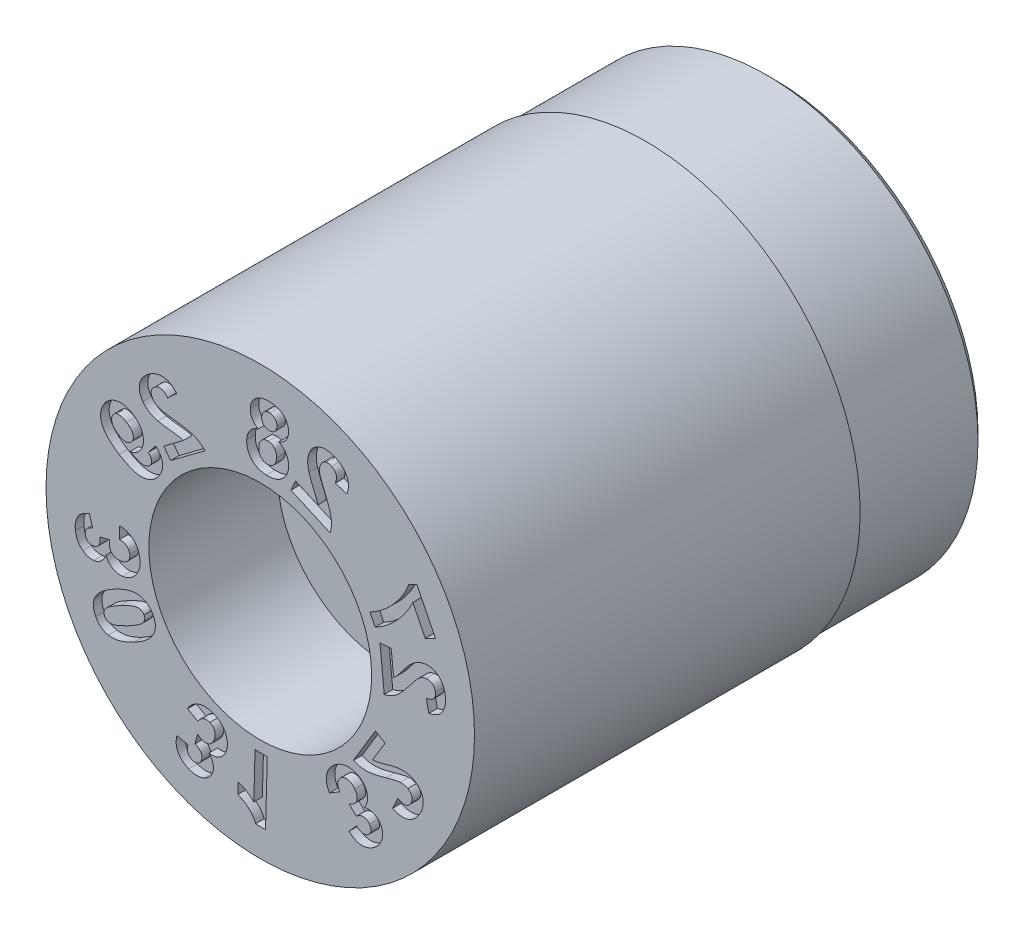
from build123d import *

# Parameters (mm, degrees)
SKETCH4_W          = 3
SKETCH4_H          = 1
CUT_EXTRUDE1_DEPTH = 0.2


with BuildPart() as part:
    # Sketch1 → Revolve1 (revolve)
    with BuildSketch(Plane(origin=(0, 0, 0), x_dir=(0, 0, -1), z_dir=(1, 0, 0)), mode=Mode.PRIVATE) as revolve1_sk:
        Polygon((0, 5), (0, 2.6), (3, 2.6), (3, 1.25), (12, 1.25), (12, 4.75), (11.75, 5), align=None)
    revolve(revolve1_sk.sketch.rotate(Axis((0, 0, 3.797909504), (0, 0, -1)), 90), axis=Axis((0, 0, 3.797909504), (0, 0, -1)))

    # Sketch4 → Cut-Revolve1 (revolve, cut)
    with BuildSketch(Plane(origin=(0, 0, 0), x_dir=(0, 0, -1), z_dir=(1, 0, 0)), mode=Mode.PRIVATE) as cut_revolve1_sk:
        with Locations((10.5, 5.435)):
            Rectangle(SKETCH4_W, SKETCH4_H)
    revolve(cut_revolve1_sk.sketch.rotate(Axis((0, 0, 0), (0, 0, -1)), 90), axis=Axis((0, 0, 0), (0, 0, -1)), mode=Mode.SUBTRACT)

    # Sketch5 → Cut-Extrude1 (cut)
    # profile 1 of 12: a face of its own
    with BuildSketch(Plane.XY):
        with BuildLine():
            Line((3.056168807, 0.781592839), (2.793869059, 0.755251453))
            Line((2.793869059, 0.755251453), (2.893279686, -0.234146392))
            add(Edge.make_bspline(
                [(2.893279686, -0.234146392), (2.917476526, -0.228203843), (2.965892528, -0.216313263), (3.035638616, -0.188535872), (3.102763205, -0.153408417), (3.156403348, -0.117216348), (3.199521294, -0.082990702), (3.233965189, -0.051531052), (3.270491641, -0.014861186), (3.309809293, 0.026410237), (3.350899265, 0.073258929), (3.394220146, 0.125303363), (3.4400345, 0.182283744), (3.470698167, 0.222435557), (3.486557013, 0.243201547)],
                knots=[0, 0, 0, 0, 1.148974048, 2.299008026, 3.454845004, 4.640560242, 5.279486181, 5.994686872, 6.792278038, 7.668350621, 8.625394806, 9.668028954, 10.793935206, 12, 12, 12, 12], degree=3))
            add(Edge.make_bspline(
                [(3.486557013, 0.243201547), (3.49921914, 0.25979202), (3.523389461, 0.291461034), (3.558345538, 0.336192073), (3.59041111, 0.375840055), (3.618959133, 0.410842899), (3.64486672, 0.440559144), (3.667427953, 0.465375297), (3.686567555, 0.485528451), (3.6989342, 0.496599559), (3.704426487, 0.501516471)],
                knots=[0, 0, 0, 0, 1.480494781, 2.826068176, 4.026898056, 5.097723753, 6.029986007, 6.822964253, 7.477253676, 8, 8, 8, 8], degree=3))
            add(Edge.make_bspline(
                [(3.704426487, 0.501516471), (3.717807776, 0.511798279), (3.743766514, 0.531744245), (3.785577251, 0.554584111), (3.827971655, 0.570655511), (3.856924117, 0.575052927), (3.871219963, 0.577224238)],
                knots=[0, 0, 0, 0, 1.088908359, 2.112403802, 3.067962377, 4, 4, 4, 4], degree=3))
            add(Edge.make_bspline(
                [(3.871219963, 0.577224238), (3.886153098, 0.578229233), (3.91457985, 0.580142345), (3.955323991, 0.574417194), (3.991344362, 0.561855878), (4.022218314, 0.542121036), (4.047751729, 0.516149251), (4.06697723, 0.484260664), (4.080942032, 0.44721454), (4.084496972, 0.42026352), (4.086363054, 0.406116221)],
                knots=[0, 0, 0, 0, 1.148583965, 2.186447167, 3.14023846, 4.060887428, 4.979600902, 5.915431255, 6.905755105, 8, 8, 8, 8], degree=3))
            add(Edge.make_bspline(
                [(4.086363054, 0.406116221), (4.087136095, 0.39206949), (4.088625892, 0.364998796), (4.082862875, 0.325661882), (4.068719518, 0.290449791), (4.051492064, 0.264382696), (4.034190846, 0.245698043), (4.01837191, 0.233090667), (4.000444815, 0.221404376), (3.980006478, 0.211344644), (3.957395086, 0.202108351), (3.932455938, 0.194169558), (3.905245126, 0.186997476), (3.886188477, 0.18362464), (3.876321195, 0.18187823)],
                knots=[0, 0, 0, 0, 1.457848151, 2.809547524, 4.086812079, 5.365767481, 6.029171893, 6.721975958, 7.459356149, 8.246149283, 9.082019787, 9.992332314, 10.960456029, 12, 12, 12, 12], degree=3))
            Line((3.876321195, 0.18187823), (3.932866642, -0.096389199))
            add(Edge.make_bspline(
                [(3.932866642, -0.096389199), (3.951435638, -0.092110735), (3.987397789, -0.08382473), (4.038458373, -0.067251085), (4.085323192, -0.048288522), (4.127458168, -0.025495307), (4.165433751, -0.000250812), (4.198814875, 0.028175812), (4.227754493, 0.059589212), (4.2519885, 0.094193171), (4.272511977, 0.130881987), (4.289272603, 0.169544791), (4.302951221, 0.209704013), (4.313334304, 0.251660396), (4.32009368, 0.295421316), (4.323246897, 0.3409191), (4.323908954, 0.388183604), (4.321098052, 0.42009753), (4.319661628, 0.436406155)],
                knots=[0, 0, 0, 0, 1.240791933, 2.403013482, 3.493244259, 4.529419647, 5.518165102, 6.45862807, 7.378703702, 8.292628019, 9.204150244, 10.112842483, 11.033843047, 11.964888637, 12.924818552, 13.914274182, 14.934154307, 16, 16, 16, 16], degree=3))
            add(Edge.make_bspline(
                [(4.319661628, 0.436406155), (4.317627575, 0.454067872), (4.313655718, 0.488555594), (4.302820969, 0.538261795), (4.288941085, 0.584783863), (4.271701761, 0.628026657), (4.250977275, 0.667980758), (4.227089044, 0.704808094), (4.199262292, 0.73802626), (4.168537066, 0.7678576), (4.135346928, 0.793817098), (4.100770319, 0.816289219), (4.064409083, 0.83411914), (4.026776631, 0.848098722), (3.987808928, 0.858165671), (3.947359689, 0.863746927), (3.905516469, 0.865562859), (3.877273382, 0.86352126), (3.862923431, 0.86248395)],
                knots=[0, 0, 0, 0, 1.214814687, 2.372146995, 3.472573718, 4.53092748, 5.549593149, 6.545236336, 7.525669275, 8.505743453, 9.467587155, 10.402208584, 11.319894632, 12.230115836, 13.14278073, 14.065409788, 15.017059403, 16, 16, 16, 16], degree=3))
            add(Edge.make_bspline(
                [(3.862923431, 0.86248395), (3.84659345, 0.860418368), (3.814145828, 0.856314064), (3.766634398, 0.844804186), (3.720921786, 0.82859503), (3.676210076, 0.808605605), (3.63244605, 0.783051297), (3.588515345, 0.7524603), (3.543828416, 0.716802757), (3.515075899, 0.689932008), (3.50023728, 0.676064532)],
                knots=[0, 0, 0, 0, 0.948865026, 1.885392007, 2.812697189, 3.743235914, 4.705998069, 5.73082159, 6.828920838, 8, 8, 8, 8], degree=3))
            add(Edge.make_bspline(
                [(3.50023728, 0.676064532), (3.494929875, 0.670842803), (3.483579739, 0.65967589), (3.466151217, 0.641053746), (3.447429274, 0.619518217), (3.42704857, 0.595286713), (3.404904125, 0.568609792), (3.381491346, 0.538902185), (3.356438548, 0.506567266), (3.330616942, 0.472436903), (3.305253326, 0.43850541), (3.281247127, 0.407102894), (3.259782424, 0.378834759), (3.240501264, 0.353970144), (3.223367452, 0.332547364), (3.20882284, 0.314105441), (3.196123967, 0.299349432), (3.177124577, 0.277779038), (3.150733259, 0.25046985), (3.124815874, 0.230470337), (3.112460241, 0.220935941)],
                knots=[0, 0, 0, 0, 0.670745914, 1.434421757, 2.297132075, 3.241364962, 4.287080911, 5.420535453, 6.648906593, 7.972339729, 9.276278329, 10.465579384, 11.533486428, 12.474090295, 13.300203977, 14.004989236, 14.589871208, 15.053700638, 16.595406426, 18, 18, 18, 18], degree=3))
            Line((3.112460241, 0.220935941), (3.056168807, 0.781592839))
        make_face()
    # profile 2 of 12: a face of its own
    with BuildSketch(Plane.XY):
        with BuildLine():
            Line((3.851124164, 1.378714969), (4.088955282, 1.49710235))
            Line((4.088955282, 1.49710235), (3.652491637, 2.372320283))
            Line((3.652491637, 2.372320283), (3.466822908, 2.27971527))
            add(Edge.make_bspline(
                [(3.466822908, 2.27971527), (3.462108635, 2.26589035), (3.452445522, 2.237552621), (3.434696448, 2.194827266), (3.414475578, 2.150481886), (3.39110123, 2.104668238), (3.365113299, 2.057247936), (3.336461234, 2.008215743), (3.304755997, 1.957699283), (3.258514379, 1.888470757), (3.196352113, 1.802577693), (3.114610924, 1.704328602), (3.026683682, 1.610946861), (2.948193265, 1.538269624), (2.88370087, 1.48316508), (2.835643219, 1.444552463), (2.788578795, 1.408067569), (2.741481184, 1.374971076), (2.695292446, 1.344005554), (2.649844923, 1.315286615), (2.604520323, 1.2898814), (2.574246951, 1.274349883), (2.559338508, 1.266701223)],
                knots=[0, 0, 0, 0, 0.630800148, 1.292987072, 1.99737661, 2.735733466, 3.514029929, 4.332969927, 5.188466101, 6.089882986, 7.928912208, 9.765405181, 11.606794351, 13.465465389, 14.382906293, 15.270648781, 16.128242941, 16.954691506, 17.756515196, 18.53028892, 19.276225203, 20, 20, 20, 20], degree=3))
            Line((2.559338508, 1.266701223), (2.682212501, 1.019845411))
            add(Edge.make_bspline(
                [(2.682212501, 1.019845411), (2.704979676, 1.03214762), (2.750711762, 1.056858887), (2.817038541, 1.098594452), (2.882659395, 1.142901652), (2.94694582, 1.190724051), (3.009613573, 1.242284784), (3.071460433, 1.296485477), (3.131507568, 1.354627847), (3.190549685, 1.415252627), (3.247021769, 1.478656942), (3.301375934, 1.543222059), (3.35185124, 1.609862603), (3.400346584, 1.677009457), (3.444892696, 1.746084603), (3.486882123, 1.816120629), (3.525892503, 1.887573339), (3.549304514, 1.936430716), (3.560986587, 1.960809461)],
                knots=[0, 0, 0, 0, 0.948731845, 1.905703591, 2.872081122, 3.851871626, 4.842472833, 5.847332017, 6.866607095, 7.906674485, 8.949843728, 9.979547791, 11.000647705, 12.014701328, 13.016171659, 14.013565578, 15.008813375, 16, 16, 16, 16], degree=3))
            Line((3.560986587, 1.960809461), (3.851124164, 1.378714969))
        make_face()
    # profile 3 of 12: a face of its own
    with BuildSketch(Plane.XY):
        with BuildLine():
            Line((0.821928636, 3.048270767), (0.714935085, 2.805792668))
            Line((0.714935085, 2.805792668), (1.630206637, 2.401582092))
            add(Edge.make_bspline(
                [(1.630206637, 2.401582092), (1.63703494, 2.425770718), (1.650655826, 2.474021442), (1.66139134, 2.548820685), (1.663268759, 2.624933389), (1.658688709, 2.689939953), (1.649438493, 2.744609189), (1.639415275, 2.790475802), (1.625375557, 2.840692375), (1.608804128, 2.895586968), (1.587858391, 2.954685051), (1.564385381, 3.018519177), (1.536920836, 3.086760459), (1.517013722, 3.133560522), (1.506696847, 3.157814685)],
                knots=[0, 0, 0, 0, 1.151965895, 2.297905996, 3.454598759, 4.639274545, 5.280260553, 5.996576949, 6.791766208, 7.671347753, 8.626314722, 9.667159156, 10.791003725, 12, 12, 12, 12], degree=3))
            add(Edge.make_bspline(
                [(1.506696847, 3.157814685), (1.498467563, 3.177173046), (1.482775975, 3.214085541), (1.460992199, 3.267000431), (1.441703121, 3.314533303), (1.425872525, 3.357151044), (1.412315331, 3.394318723), (1.401944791, 3.42649559), (1.393570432, 3.453219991), (1.390230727, 3.469660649), (1.388755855, 3.476921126)],
                knots=[0, 0, 0, 0, 1.482029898, 2.825932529, 4.03182727, 5.095909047, 6.029057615, 6.818681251, 7.478309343, 8, 8, 8, 8], degree=3))
            add(Edge.make_bspline(
                [(1.388755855, 3.476921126), (1.3862551, 3.493779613), (1.381421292, 3.526366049), (1.38265409, 3.574301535), (1.389309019, 3.619350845), (1.399963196, 3.646826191), (1.405212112, 3.660362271)],
                knots=[0, 0, 0, 0, 1.092805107, 2.112326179, 3.070013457, 4, 4, 4, 4], degree=3))
            add(Edge.make_bspline(
                [(1.405212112, 3.660362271), (1.411743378, 3.673914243), (1.424204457, 3.69977021), (1.449214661, 3.732790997), (1.478346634, 3.757846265), (1.510801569, 3.7753362), (1.546343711, 3.784377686), (1.583774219, 3.785524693), (1.623051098, 3.77894708), (1.648443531, 3.768815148), (1.661749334, 3.763505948)],
                knots=[0, 0, 0, 0, 1.147683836, 2.189679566, 3.139304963, 4.063827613, 4.981448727, 5.915460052, 6.907687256, 8, 8, 8, 8], degree=3))
            add(Edge.make_bspline(
                [(1.661749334, 3.763505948), (1.67455123, 3.757235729), (1.69903259, 3.745245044), (1.730280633, 3.720261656), (1.754289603, 3.690776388), (1.768740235, 3.662723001), (1.776006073, 3.638229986), (1.779386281, 3.618224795), (1.780386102, 3.596845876), (1.77954879, 3.573973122), (1.776515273, 3.549618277), (1.770861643, 3.523923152), (1.763518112, 3.49666894), (1.757112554, 3.478294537), (1.753790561, 3.46876537)],
                knots=[0, 0, 0, 0, 1.468811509, 2.808842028, 4.093476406, 5.370802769, 6.036974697, 6.725574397, 7.460617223, 8.243243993, 9.086920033, 9.991132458, 10.958179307, 12, 12, 12, 12], degree=3))
            Line((1.753790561, 3.46876537), (2.025379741, 3.379798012))
            add(Edge.make_bspline(
                [(2.025379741, 3.379798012), (2.030808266, 3.398137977), (2.041367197, 3.433810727), (2.052362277, 3.486784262), (2.058326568, 3.53739018), (2.059993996, 3.58549602), (2.056164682, 3.631337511), (2.048283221, 3.674814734), (2.034685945, 3.715676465), (2.016776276, 3.754112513), (1.994684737, 3.7900927), (1.969376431, 3.824042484), (1.941069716, 3.856070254), (1.909234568, 3.885781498), (1.874476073, 3.9136825), (1.836322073, 3.939224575), (1.794983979, 3.962661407), (1.765775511, 3.976262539), (1.750899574, 3.983189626)],
                knots=[0, 0, 0, 0, 1.237575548, 2.407186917, 3.496369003, 4.532498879, 5.516688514, 6.468424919, 7.38532502, 8.295670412, 9.207238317, 10.112885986, 11.033513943, 11.969735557, 12.927875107, 13.91528332, 14.938249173, 16, 16, 16, 16], degree=3))
            add(Edge.make_bspline(
                [(1.750899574, 3.983189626), (1.734354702, 3.990087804), (1.70210595, 4.003533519), (1.653371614, 4.018952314), (1.605847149, 4.029801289), (1.559493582, 4.036029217), (1.514260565, 4.037731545), (1.470189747, 4.034917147), (1.427336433, 4.027245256), (1.386003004, 4.015028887), (1.346714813, 3.999093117), (1.310100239, 3.979575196), (1.276264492, 3.956920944), (1.245206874, 3.931170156), (1.217311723, 3.901825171), (1.19208846, 3.869408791), (1.169739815, 3.833650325), (1.157590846, 3.807911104), (1.151441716, 3.794883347)],
                knots=[0, 0, 0, 0, 1.218276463, 2.374626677, 3.470312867, 4.528821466, 5.549707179, 6.543033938, 7.525469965, 8.503103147, 9.468324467, 10.403159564, 11.319051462, 12.232484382, 13.140264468, 14.066127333, 15.021181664, 16, 16, 16, 16], degree=3))
            add(Edge.make_bspline(
                [(1.151441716, 3.794883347), (1.145087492, 3.779464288), (1.132522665, 3.74897468), (1.119507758, 3.701438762), (1.110568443, 3.65346638), (1.106430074, 3.604284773), (1.107056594, 3.553308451), (1.112112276, 3.499746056), (1.120864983, 3.442994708), (1.130081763, 3.404573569), (1.134844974, 3.384717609)],
                knots=[0, 0, 0, 0, 0.955021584, 1.888457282, 2.818444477, 3.748715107, 4.712187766, 5.73632547, 6.830137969, 8, 8, 8, 8], degree=3))
            add(Edge.make_bspline(
                [(1.134844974, 3.384717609), (1.136801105, 3.377449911), (1.140970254, 3.361960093), (1.148789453, 3.33749408), (1.157775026, 3.310175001), (1.168927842, 3.280336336), (1.181467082, 3.247749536), (1.195845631, 3.212538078), (1.211756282, 3.174583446), (1.228868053, 3.135081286), (1.24591465, 3.096073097), (1.26184745, 3.059649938), (1.275425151, 3.026664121), (1.287925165, 2.997619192), (1.298296, 2.971963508), (1.306650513, 2.949867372), (1.313741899, 2.931503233), (1.322949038, 2.904088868), (1.333578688, 2.867395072), (1.338231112, 2.83485102), (1.340446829, 2.819351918)],
                knots=[0, 0, 0, 0, 0.673821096, 1.436130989, 2.299378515, 3.248669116, 4.28791496, 5.425765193, 6.654036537, 7.972872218, 9.28031518, 10.465834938, 11.532428, 12.474147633, 13.297088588, 14.009889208, 14.589441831, 15.059318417, 16.599500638, 18, 18, 18, 18], degree=3))
            Line((1.340446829, 2.819351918), (0.821928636, 3.048270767))
        make_face()
    # profile 4 of 12: a face of its own
    with BuildSketch(Plane.XY):
        with BuildLine():
            add(Edge.make_bspline(
                [(0.432232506, 3.64133147), (0.441438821, 3.644742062), (0.459462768, 3.651419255), (0.484799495, 3.663867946), (0.508884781, 3.676456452), (0.530464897, 3.691345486), (0.55082312, 3.706687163), (0.569163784, 3.723475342), (0.585673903, 3.741416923), (0.60479622, 3.766852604), (0.624603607, 3.800926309), (0.643011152, 3.844206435), (0.655035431, 3.890008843), (0.657861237, 3.921446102), (0.659288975, 3.937329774)],
                knots=[0, 0, 0, 0, 0.88798208, 1.738474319, 2.553233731, 3.344867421, 4.107954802, 4.859320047, 5.591853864, 6.311711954, 7.735758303, 9.146817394, 10.558429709, 12, 12, 12, 12], degree=3))
            add(Edge.make_bspline(
                [(0.659288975, 3.937329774), (0.659680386, 3.950916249), (0.660451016, 3.977666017), (0.657025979, 4.017042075), (0.649576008, 4.05476703), (0.639152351, 4.090994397), (0.624334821, 4.12548422), (0.606038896, 4.158393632), (0.583728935, 4.189460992), (0.558144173, 4.218862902), (0.528926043, 4.24583049), (0.496260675, 4.26995092), (0.460187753, 4.290638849), (0.421019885, 4.308077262), (0.378697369, 4.322205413), (0.333119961, 4.332950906), (0.284310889, 4.340497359), (0.250618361, 4.3430076), (0.233330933, 4.344295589)],
                knots=[0, 0, 0, 0, 0.981735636, 1.93289291, 2.848801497, 3.757530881, 4.651846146, 5.555603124, 6.473540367, 7.410908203, 8.36785966, 9.341179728, 10.339271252, 11.36708045, 12.4348706, 13.558981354, 14.747528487, 16, 16, 16, 16], degree=3))
            add(Edge.make_bspline(
                [(0.233330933, 4.344295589), (0.21614141, 4.34483309), (0.182636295, 4.345880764), (0.133668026, 4.343536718), (0.087441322, 4.33756148), (0.043997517, 4.328038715), (0.003308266, 4.31472525), (-0.034517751, 4.297853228), (-0.069662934, 4.277541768), (-0.101684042, 4.253677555), (-0.130669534, 4.227269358), (-0.156345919, 4.198687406), (-0.178028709, 4.167821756), (-0.196451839, 4.135069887), (-0.211351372, 4.100290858), (-0.22246215, 4.063469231), (-0.229948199, 4.0246573), (-0.232052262, 3.998034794), (-0.233126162, 3.984446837)],
                knots=[0, 0, 0, 0, 1.243563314, 2.423902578, 3.541432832, 4.611288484, 5.635940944, 6.632471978, 7.601852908, 8.565777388, 9.515136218, 10.433929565, 11.338823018, 12.237751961, 13.147475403, 14.069575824, 15.014723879, 16, 16, 16, 16], degree=3))
            add(Edge.make_bspline(
                [(-0.233126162, 3.984446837), (-0.233402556, 3.967575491), (-0.233944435, 3.934498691), (-0.226010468, 3.885979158), (-0.211334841, 3.840012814), (-0.18979248, 3.796968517), (-0.162211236, 3.757288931), (-0.128456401, 3.722025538), (-0.089281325, 3.690820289), (-0.05949529, 3.674766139), (-0.04431356, 3.666583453)],
                knots=[0, 0, 0, 0, 1.030212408, 2.019763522, 2.990578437, 3.971007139, 4.952296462, 5.934235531, 6.947094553, 8, 8, 8, 8], degree=3))
            add(Edge.make_bspline(
                [(-0.04431356, 3.666583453), (-0.054652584, 3.662890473), (-0.074976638, 3.655630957), (-0.103871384, 3.642252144), (-0.130957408, 3.627399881), (-0.156624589, 3.611558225), (-0.180249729, 3.593736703), (-0.20200347, 3.574449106), (-0.222167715, 3.553826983), (-0.24040926, 3.531664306), (-0.256879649, 3.508271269), (-0.271181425, 3.483631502), (-0.284085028, 3.458158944), (-0.294187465, 3.43130489), (-0.303157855, 3.403766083), (-0.309220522, 3.374951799), (-0.314098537, 3.345300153), (-0.315514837, 3.325091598), (-0.316229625, 3.314892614)],
                knots=[0, 0, 0, 0, 1.110150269, 2.182290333, 3.216561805, 4.234071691, 5.230580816, 6.205900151, 7.17276219, 8.145077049, 9.106562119, 10.063337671, 11.025089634, 11.991048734, 12.962729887, 13.951845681, 14.96632425, 16, 16, 16, 16], degree=3))
            add(Edge.make_bspline(
                [(-0.316229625, 3.314892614), (-0.31665558, 3.298089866), (-0.317488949, 3.265215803), (-0.314265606, 3.216716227), (-0.306005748, 3.170610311), (-0.294012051, 3.126433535), (-0.277556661, 3.084652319), (-0.257119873, 3.044723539), (-0.231871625, 3.007465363), (-0.202986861, 2.972347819), (-0.17066698, 2.940263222), (-0.134807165, 2.912159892), (-0.096208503, 2.887752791), (-0.054599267, 2.867317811), (-0.010084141, 2.850780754), (0.0373783, 2.838359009), (0.087718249, 2.829582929), (0.122343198, 2.827121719), (0.140038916, 2.825863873)],
                knots=[0, 0, 0, 0, 1.070876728, 2.095137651, 3.091183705, 4.051320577, 5.007737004, 5.947825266, 6.904049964, 7.870004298, 8.841971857, 9.800069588, 10.767814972, 11.747278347, 12.748953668, 13.788965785, 14.870010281, 16, 16, 16, 16], degree=3))
            add(Edge.make_bspline(
                [(0.140038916, 2.825863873), (0.156620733, 2.82526637), (0.189121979, 2.824095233), (0.237078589, 2.826723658), (0.283045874, 2.83273594), (0.327147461, 2.841886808), (0.36924229, 2.854792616), (0.409427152, 2.871103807), (0.447689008, 2.890898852), (0.471444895, 2.906777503), (0.483299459, 2.914701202)],
                knots=[0, 0, 0, 0, 1.101306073, 2.158618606, 3.184550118, 4.177263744, 5.145732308, 6.103823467, 7.053777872, 8, 8, 8, 8], degree=3))
            add(Edge.make_bspline(
                [(0.483299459, 2.914701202), (0.496497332, 2.924743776), (0.522501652, 2.94453108), (0.557245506, 2.97859376), (0.586651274, 3.016244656), (0.611332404, 3.056973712), (0.631585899, 3.100689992), (0.64633167, 3.147872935), (0.656669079, 3.19813923), (0.659398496, 3.232892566), (0.660795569, 3.250681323)],
                knots=[0, 0, 0, 0, 1.009187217, 1.988443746, 2.953003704, 3.910616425, 4.882667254, 5.879038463, 6.914369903, 8, 8, 8, 8], degree=3))
            add(Edge.make_bspline(
                [(0.660795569, 3.250681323), (0.661106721, 3.27047161), (0.661721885, 3.309598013), (0.653207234, 3.367404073), (0.637566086, 3.423102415), (0.617992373, 3.467365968), (0.598505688, 3.501000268), (0.581424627, 3.525132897), (0.562196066, 3.547999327), (0.540397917, 3.569264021), (0.516734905, 3.58942396), (0.490747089, 3.608238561), (0.462450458, 3.625674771), (0.442407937, 3.636059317), (0.432232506, 3.64133147)],
                knots=[0, 0, 0, 0, 1.476631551, 2.919375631, 4.346355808, 5.787682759, 6.521005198, 7.24742382, 7.993612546, 8.749677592, 9.51964752, 10.314096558, 11.144080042, 12, 12, 12, 12], degree=3))
        make_face()
        with BuildLine():
            add(Edge.make_bspline(
                [(0.388547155, 3.93147895), (0.387328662, 3.917975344), (0.385005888, 3.892233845), (0.373786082, 3.856496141), (0.357217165, 3.8254503), (0.334230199, 3.800243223), (0.306754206, 3.780395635), (0.27509861, 3.766895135), (0.23974683, 3.759958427), (0.215215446, 3.760099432), (0.202458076, 3.76017276)],
                knots=[0, 0, 0, 0, 1.135055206, 2.163720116, 3.120683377, 4.06560982, 5.000311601, 5.944938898, 6.931280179, 8, 8, 8, 8], degree=3))
            add(Edge.make_bspline(
                [(0.202458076, 3.76017276), (0.189537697, 3.76129478), (0.164735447, 3.763448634), (0.130279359, 3.775176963), (0.099674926, 3.791503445), (0.0744648, 3.814556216), (0.054239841, 3.842350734), (0.040735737, 3.875073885), (0.033137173, 3.911874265), (0.03355958, 3.937658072), (0.033780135, 3.95112084)],
                knots=[0, 0, 0, 0, 1.077618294, 2.06862042, 3.011697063, 3.950511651, 4.89095922, 5.855425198, 6.880230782, 8, 8, 8, 8], degree=3))
            add(Edge.make_bspline(
                [(0.033780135, 3.95112084), (0.034930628, 3.963825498), (0.037145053, 3.988278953), (0.048235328, 4.022574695), (0.065061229, 4.052659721), (0.088059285, 4.077553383), (0.115228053, 4.097678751), (0.146712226, 4.11105157), (0.181554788, 4.118737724), (0.205840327, 4.118278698), (0.21849936, 4.118039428)],
                knots=[0, 0, 0, 0, 1.088499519, 2.095103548, 3.058208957, 4.014505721, 4.973026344, 5.92847822, 6.920202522, 8, 8, 8, 8], degree=3))
            add(Edge.make_bspline(
                [(0.21849936, 4.118039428), (0.231497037, 4.116853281), (0.25643302, 4.114577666), (0.291531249, 4.103516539), (0.321939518, 4.086158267), (0.347716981, 4.063407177), (0.367489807, 4.035624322), (0.381599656, 4.004136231), (0.388822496, 3.968799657), (0.388641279, 3.944236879), (0.388547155, 3.93147895)],
                knots=[0, 0, 0, 0, 1.098810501, 2.108062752, 3.076737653, 4.033508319, 4.985077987, 5.931531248, 6.925635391, 8, 8, 8, 8], degree=3))
        make_face(mode=Mode.SUBTRACT)
        with BuildLine():
            add(Edge.make_bspline(
                [(0.381231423, 3.292897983), (0.380594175, 3.283395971), (0.379352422, 3.264880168), (0.374804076, 3.238001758), (0.369064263, 3.212688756), (0.360995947, 3.189216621), (0.351566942, 3.167356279), (0.339964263, 3.14739265), (0.326861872, 3.12891329), (0.311799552, 3.112465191), (0.295402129, 3.097882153), (0.278198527, 3.08515283), (0.259882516, 3.074846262), (0.240919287, 3.066712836), (0.221236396, 3.059990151), (0.200570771, 3.056008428), (0.179096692, 3.053900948), (0.164594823, 3.054357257), (0.15724626, 3.054588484)],
                knots=[0, 0, 0, 0, 1.242581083, 2.421317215, 3.555093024, 4.627399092, 5.657158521, 6.658289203, 7.636350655, 8.609328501, 9.56286702, 10.497934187, 11.39786839, 12.29970079, 13.189314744, 14.107495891, 15.04100728, 16, 16, 16, 16], degree=3))
            add(Edge.make_bspline(
                [(0.15724626, 3.054588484), (0.150058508, 3.055218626), (0.1359565, 3.056454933), (0.11531691, 3.060468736), (0.09575389, 3.06637281), (0.077273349, 3.074495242), (0.059950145, 3.084524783), (0.043483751, 3.096249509), (0.028248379, 3.110059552), (0.014255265, 3.125752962), (0.001450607, 3.143165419), (-0.009452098, 3.162340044), (-0.018201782, 3.183315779), (-0.025219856, 3.205783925), (-0.030059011, 3.230037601), (-0.033577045, 3.255889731), (-0.034351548, 3.283426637), (-0.03374035, 3.302272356), (-0.033427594, 3.311915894)],
                knots=[0, 0, 0, 0, 0.95866033, 1.880843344, 2.789567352, 3.669649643, 4.557852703, 5.446355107, 6.351854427, 7.285120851, 8.237193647, 9.220051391, 10.209381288, 11.253123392, 12.343712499, 13.493414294, 14.717355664, 16, 16, 16, 16], degree=3))
            add(Edge.make_bspline(
                [(-0.033427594, 3.311915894), (-0.03289302, 3.320421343), (-0.031848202, 3.337045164), (-0.027615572, 3.361149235), (-0.022057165, 3.383957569), (-0.014288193, 3.405271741), (-0.004834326, 3.425277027), (0.006036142, 3.444143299), (0.019240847, 3.461247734), (0.033826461, 3.476933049), (0.049783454, 3.49080741), (0.066458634, 3.503174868), (0.084347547, 3.513088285), (0.102972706, 3.521147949), (0.122585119, 3.526978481), (0.143039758, 3.53082483), (0.164392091, 3.532942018), (0.178893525, 3.532482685), (0.186241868, 3.532249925)],
                knots=[0, 0, 0, 0, 1.169881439, 2.28652252, 3.356760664, 4.39128862, 5.39648598, 6.394026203, 7.375687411, 8.358119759, 9.33184157, 10.276849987, 11.204571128, 12.134737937, 13.05980231, 14.008709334, 14.990948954, 16, 16, 16, 16], degree=3))
            add(Edge.make_bspline(
                [(0.186241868, 3.532249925), (0.194645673, 3.531671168), (0.211092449, 3.530538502), (0.234650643, 3.525443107), (0.256498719, 3.518628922), (0.276734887, 3.509976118), (0.294856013, 3.498587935), (0.311263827, 3.485146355), (0.326079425, 3.469749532), (0.342545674, 3.446084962), (0.359303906, 3.414699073), (0.373673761, 3.375199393), (0.381557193, 3.334347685), (0.381340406, 3.30676457), (0.381231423, 3.292897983)],
                knots=[0, 0, 0, 0, 0.874655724, 1.711756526, 2.497901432, 3.251950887, 3.992363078, 4.714316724, 5.452896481, 6.205146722, 7.70394408, 9.138209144, 10.561320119, 12, 12, 12, 12], degree=3))
        make_face(mode=Mode.SUBTRACT)
    # profile 5 of 12: a face of its own
    with BuildSketch(Plane.XY):
        with BuildLine():
            Line((-2.25188539, 2.21507303), (-2.09294888, 2.00171841))
            Line((-2.09294888, 2.00171841), (-1.288297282, 2.601225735))
            add(Edge.make_bspline(
                [(-1.288297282, 2.601225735), (-1.305953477, 2.619217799), (-1.341129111, 2.65506257), (-1.401659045, 2.700657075), (-1.466565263, 2.740764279), (-1.525785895, 2.768338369), (-1.577841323, 2.787653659), (-1.622986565, 2.801240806), (-1.673744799, 2.814133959), (-1.730089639, 2.826050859), (-1.791890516, 2.837654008), (-1.859291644, 2.848250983), (-1.932349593, 2.858137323), (-1.983019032, 2.86378653), (-2.009303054, 2.866716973)],
                knots=[0, 0, 0, 0, 1.151623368, 2.294326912, 3.455615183, 4.636786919, 5.274942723, 5.994245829, 6.792063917, 7.669816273, 8.628074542, 9.668024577, 10.790322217, 12, 12, 12, 12], degree=3))
            add(Edge.make_bspline(
                [(-2.009303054, 2.866716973), (-2.030237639, 2.869032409), (-2.070141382, 2.873445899), (-2.126944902, 2.880773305), (-2.177853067, 2.887742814), (-2.222846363, 2.894609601), (-2.262079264, 2.901063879), (-2.29528293, 2.907948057), (-2.322691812, 2.91423874), (-2.338682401, 2.919209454), (-2.345762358, 2.921410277)],
                knots=[0, 0, 0, 0, 1.481085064, 2.823119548, 4.027453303, 5.094262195, 6.023800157, 6.822811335, 7.478790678, 8, 8, 8, 8], degree=3))
            add(Edge.make_bspline(
                [(-2.345762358, 2.921410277), (-2.361617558, 2.927686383), (-2.392238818, 2.939807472), (-2.433956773, 2.963868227), (-2.469607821, 2.992500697), (-2.488569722, 3.015264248), (-2.497857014, 3.026413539)],
                knots=[0, 0, 0, 0, 1.090773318, 2.106618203, 3.072646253, 4, 4, 4, 4], degree=3))
            add(Edge.make_bspline(
                [(-2.497857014, 3.026413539), (-2.506383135, 3.038931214), (-2.522566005, 3.062690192), (-2.539275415, 3.100771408), (-2.54715228, 3.138577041), (-2.545938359, 3.17562527), (-2.536650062, 3.211138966), (-2.519034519, 3.244408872), (-2.493793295, 3.275476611), (-2.472326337, 3.29272925), (-2.461103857, 3.301748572)],
                knots=[0, 0, 0, 0, 1.150464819, 2.183621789, 3.14145639, 4.063716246, 4.978580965, 5.909581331, 6.907172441, 8, 8, 8, 8], degree=3))
            add(Edge.make_bspline(
                [(-2.461103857, 3.301748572), (-2.449395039, 3.309848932), (-2.426863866, 3.325436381), (-2.389525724, 3.340077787), (-2.35185617, 3.346663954), (-2.320249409, 3.345332), (-2.295228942, 3.339502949), (-2.276165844, 3.332490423), (-2.256923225, 3.322807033), (-2.237313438, 3.310815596), (-2.21800474, 3.295506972), (-2.197924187, 3.278494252), (-2.178217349, 3.25816731), (-2.165375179, 3.243512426), (-2.158707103, 3.235903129)],
                knots=[0, 0, 0, 0, 1.461654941, 2.812649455, 4.089870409, 5.375180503, 6.036322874, 6.728338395, 7.460582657, 8.250914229, 9.08959948, 9.994083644, 10.958462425, 12, 12, 12, 12], degree=3))
            Line((-2.158707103, 3.235903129), (-1.946633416, 3.429403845))
            add(Edge.make_bspline(
                [(-1.946633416, 3.429403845), (-1.959899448, 3.443275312), (-1.985626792, 3.4701768), (-2.026743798, 3.505645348), (-2.067894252, 3.535959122), (-2.109220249, 3.561182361), (-2.150979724, 3.58058604), (-2.192915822, 3.594786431), (-2.235142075, 3.603764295), (-2.277638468, 3.606871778), (-2.319943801, 3.605020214), (-2.36216627, 3.600180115), (-2.404123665, 3.590941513), (-2.445704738, 3.577835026), (-2.487123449, 3.561075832), (-2.528182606, 3.540408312), (-2.569345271, 3.516267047), (-2.595475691, 3.497287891), (-2.608810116, 3.487602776)],
                knots=[0, 0, 0, 0, 1.238016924, 2.400935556, 3.498752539, 4.533409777, 5.519695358, 6.463912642, 7.384994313, 8.297783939, 9.205295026, 10.114255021, 11.037103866, 11.972876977, 12.924761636, 13.917043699, 14.9370617, 16, 16, 16, 16], degree=3))
            add(Edge.make_bspline(
                [(-2.608810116, 3.487602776), (-2.622999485, 3.476643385), (-2.650695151, 3.455252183), (-2.68810118, 3.420177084), (-2.721042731, 3.383982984), (-2.74967816, 3.346788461), (-2.773180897, 3.307915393), (-2.79246038, 3.268107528), (-2.806997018, 3.226903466), (-2.816674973, 3.184810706), (-2.821954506, 3.142558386), (-2.823741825, 3.100893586), (-2.820268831, 3.060131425), (-2.812832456, 3.020371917), (-2.801760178, 2.98127622), (-2.785223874, 2.943512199), (-2.765533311, 2.906158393), (-2.748938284, 2.882976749), (-2.740515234, 2.871210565)],
                knots=[0, 0, 0, 0, 1.214669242, 2.370864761, 3.470068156, 4.529234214, 5.546856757, 6.54354374, 7.522289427, 8.501788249, 9.464964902, 10.405187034, 11.322985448, 12.230812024, 13.144105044, 14.069828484, 15.020312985, 16, 16, 16, 16], degree=3))
            add(Edge.make_bspline(
                [(-2.740515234, 2.871210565), (-2.730284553, 2.858140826), (-2.709905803, 2.832106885), (-2.675031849, 2.797141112), (-2.637504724, 2.765556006), (-2.596439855, 2.738032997), (-2.55191354, 2.71280299), (-2.502451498, 2.690989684), (-2.448569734, 2.670491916), (-2.410431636, 2.659731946), (-2.390757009, 2.654181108)],
                knots=[0, 0, 0, 0, 0.947730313, 1.887807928, 2.815961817, 3.746389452, 4.70864712, 5.73666121, 6.832392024, 8, 8, 8, 8], degree=3))
            add(Edge.make_bspline(
                [(-2.390757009, 2.654181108), (-2.383489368, 2.652251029), (-2.367963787, 2.648127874), (-2.342834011, 2.643044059), (-2.314621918, 2.637746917), (-2.283160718, 2.632402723), (-2.248488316, 2.627473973), (-2.210572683, 2.622387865), (-2.169551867, 2.617710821), (-2.126508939, 2.613193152), (-2.084053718, 2.608740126), (-2.044359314, 2.604499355), (-2.008779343, 2.600385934), (-1.977182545, 2.596668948), (-1.949699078, 2.593116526), (-1.92618929, 2.590068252), (-1.906784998, 2.586606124), (-1.878152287, 2.581755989), (-1.841131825, 2.572392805), (-1.81059169, 2.560380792), (-1.796105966, 2.554683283)],
                knots=[0, 0, 0, 0, 0.671627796, 1.434772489, 2.289517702, 3.236218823, 4.285260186, 5.417971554, 6.65368667, 7.973430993, 9.284379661, 10.467261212, 11.539701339, 12.48411625, 13.309361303, 14.015507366, 14.60150824, 15.069885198, 16.610194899, 18, 18, 18, 18], degree=3))
            Line((-1.796105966, 2.554683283), (-2.25188539, 2.21507303))
        make_face()
    # profile 6 of 12: a face of its own
    with BuildSketch(Plane.XY):
        with BuildLine():
            Line((-2.439505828, 2.124261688), (-2.61338983, 1.90817223))
            add(Edge.make_bspline(
                [(-2.61338983, 1.90817223), (-2.603410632, 1.899364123), (-2.584498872, 1.882671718), (-2.561315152, 1.855092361), (-2.545083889, 1.826639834), (-2.535804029, 1.797500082), (-2.533203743, 1.767855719), (-2.5371354, 1.738155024), (-2.546802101, 1.708196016), (-2.557617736, 1.689630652), (-2.563248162, 1.679965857)],
                knots=[0, 0, 0, 0, 1.225832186, 2.32309689, 3.304520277, 4.22637983, 5.120069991, 6.024332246, 6.971502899, 8, 8, 8, 8], degree=3))
            add(Edge.make_bspline(
                [(-2.563248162, 1.679965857), (-2.56733499, 1.674003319), (-2.575391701, 1.662248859), (-2.590091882, 1.646883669), (-2.606225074, 1.633335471), (-2.623920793, 1.62162177), (-2.643707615, 1.612674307), (-2.664991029, 1.605474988), (-2.687940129, 1.600061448), (-2.713010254, 1.596900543), (-2.740896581, 1.596633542), (-2.772235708, 1.601182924), (-2.807220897, 1.609658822), (-2.846123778, 1.621904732), (-2.888815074, 1.638360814), (-2.935397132, 1.658795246), (-2.985601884, 1.683630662), (-3.020014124, 1.702058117), (-3.037974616, 1.711675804)],
                knots=[0, 0, 0, 0, 0.659043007, 1.299227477, 1.933638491, 2.580256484, 3.229520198, 3.910160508, 4.629332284, 5.378349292, 6.213112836, 7.16695657, 8.260945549, 9.497356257, 10.887720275, 12.436177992, 14.139964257, 16, 16, 16, 16], degree=3))
            add(Edge.make_bspline(
                [(-3.037974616, 1.711675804), (-3.024766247, 1.714020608), (-2.998888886, 1.718614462), (-2.961530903, 1.729489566), (-2.926835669, 1.744505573), (-2.894098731, 1.762425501), (-2.86415131, 1.784636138), (-2.83624992, 1.809811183), (-2.810822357, 1.838634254), (-2.796316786, 1.860036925), (-2.788937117, 1.870925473)],
                knots=[0, 0, 0, 0, 1.053546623, 2.064070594, 3.04823703, 4.018749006, 4.989484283, 5.970152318, 6.967320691, 8, 8, 8, 8], degree=3))
            add(Edge.make_bspline(
                [(-2.788937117, 1.870925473), (-2.78153775, 1.883257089), (-2.766937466, 1.907589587), (-2.750083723, 1.946363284), (-2.737094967, 1.985886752), (-2.728609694, 2.026583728), (-2.724791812, 2.068320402), (-2.725473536, 2.111065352), (-2.73016115, 2.154780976), (-2.739248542, 2.19902652), (-2.75257315, 2.242869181), (-2.77071269, 2.285065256), (-2.792553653, 2.325488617), (-2.81961399, 2.363432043), (-2.850335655, 2.399743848), (-2.885389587, 2.434207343), (-2.924960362, 2.466256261), (-2.953693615, 2.485508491), (-2.968355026, 2.495332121)],
                knots=[0, 0, 0, 0, 0.951212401, 1.87691333, 2.791816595, 3.701587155, 4.622788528, 5.560664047, 6.527351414, 7.529349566, 8.546828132, 9.555278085, 10.565361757, 11.582516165, 12.634583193, 13.711025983, 14.832029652, 16, 16, 16, 16], degree=3))
            add(Edge.make_bspline(
                [(-2.968355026, 2.495332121), (-2.984015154, 2.504944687), (-3.014723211, 2.523794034), (-3.062572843, 2.546514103), (-3.110279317, 2.564440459), (-3.157821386, 2.57773008), (-3.205435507, 2.585443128), (-3.25296038, 2.588566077), (-3.300421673, 2.586292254), (-3.347458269, 2.579312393), (-3.393256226, 2.567713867), (-3.436904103, 2.551204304), (-3.478550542, 2.531111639), (-3.517470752, 2.506167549), (-3.554160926, 2.477209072), (-3.587887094, 2.443523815), (-3.620051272, 2.406328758), (-3.638470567, 2.378627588), (-3.647848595, 2.364523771)],
                knots=[0, 0, 0, 0, 1.133696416, 2.223073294, 3.263699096, 4.277093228, 5.26494473, 6.236109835, 7.212124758, 8.192302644, 9.167337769, 10.122445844, 11.068666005, 12.016622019, 12.970448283, 13.948302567, 14.955395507, 16, 16, 16, 16], degree=3))
            add(Edge.make_bspline(
                [(-3.647848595, 2.364523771), (-3.657355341, 2.348755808), (-3.676103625, 2.317659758), (-3.69755616, 2.268374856), (-3.713007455, 2.218382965), (-3.72317598, 2.167758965), (-3.726166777, 2.116188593), (-3.724008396, 2.063863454), (-3.715430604, 2.010776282), (-3.701132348, 1.956864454), (-3.679640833, 1.90230115), (-3.648875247, 1.848257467), (-3.610616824, 1.793849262), (-3.563499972, 1.739855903), (-3.507921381, 1.686190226), (-3.444540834, 1.631994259), (-3.372525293, 1.578218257), (-3.320676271, 1.544093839), (-3.293797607, 1.526403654)],
                knots=[0, 0, 0, 0, 0.858835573, 1.693712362, 2.501435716, 3.298312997, 4.097655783, 4.906947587, 5.738702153, 6.602766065, 7.506675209, 8.467792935, 9.49871549, 10.607293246, 11.807464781, 13.102683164, 14.498023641, 16, 16, 16, 16], degree=3))
            add(Edge.make_bspline(
                [(-3.293797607, 1.526403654), (-3.265876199, 1.509110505), (-3.21204597, 1.475770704), (-3.131137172, 1.432721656), (-3.053946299, 1.396961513), (-2.980051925, 1.368984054), (-2.909379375, 1.349187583), (-2.84213482, 1.336870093), (-2.778214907, 1.332250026), (-2.717756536, 1.336175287), (-2.660707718, 1.346234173), (-2.607028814, 1.362359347), (-2.556352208, 1.383376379), (-2.509044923, 1.410092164), (-2.464962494, 1.442285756), (-2.424240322, 1.480055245), (-2.386492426, 1.523113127), (-2.36482511, 1.555225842), (-2.353774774, 1.571603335)],
                knots=[0, 0, 0, 0, 1.478918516, 2.851236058, 4.124920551, 5.308418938, 6.405945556, 7.425971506, 8.382947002, 9.284345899, 10.147700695, 10.986655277, 11.803797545, 12.613773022, 13.427721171, 14.256621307, 15.11087643, 16, 16, 16, 16], degree=3))
            add(Edge.make_bspline(
                [(-2.353774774, 1.571603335), (-2.346330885, 1.583698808), (-2.331824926, 1.607269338), (-2.313796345, 1.643829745), (-2.299167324, 1.680071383), (-2.287777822, 1.716157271), (-2.280770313, 1.752221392), (-2.276516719, 1.78790003), (-2.276520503, 1.823478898), (-2.279532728, 1.858811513), (-2.286542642, 1.893902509), (-2.297451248, 1.928374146), (-2.311462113, 1.962587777), (-2.329993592, 1.995868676), (-2.351556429, 2.029144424), (-2.377606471, 2.061426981), (-2.40664987, 2.093778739), (-2.428387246, 2.113946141), (-2.439505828, 2.124261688)],
                knots=[0, 0, 0, 0, 1.101028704, 2.145582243, 3.156819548, 4.130325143, 5.074982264, 6.002231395, 6.912667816, 7.829214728, 8.748653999, 9.681386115, 10.629900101, 11.610662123, 12.631254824, 13.701461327, 14.82430652, 16, 16, 16, 16], degree=3))
        make_face()
        with BuildLine():
            add(Edge.make_bspline(
                [(-3.310607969, 1.915927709), (-3.319933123, 1.922108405), (-3.338073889, 1.934132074), (-3.363044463, 1.953865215), (-3.385794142, 1.973649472), (-3.405429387, 1.994520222), (-3.422441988, 2.015865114), (-3.436756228, 2.037950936), (-3.44840215, 2.060647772), (-3.457035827, 2.083903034), (-3.463659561, 2.106847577), (-3.467265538, 2.129445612), (-3.469420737, 2.151212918), (-3.468354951, 2.172204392), (-3.465543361, 2.192521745), (-3.459771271, 2.211921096), (-3.452486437, 2.231022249), (-3.445400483, 2.242691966), (-3.441815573, 2.248595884)],
                knots=[0, 0, 0, 0, 1.347745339, 2.621847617, 3.832855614, 4.978059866, 6.070181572, 7.118389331, 8.145106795, 9.137617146, 10.10409234, 11.017787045, 11.892367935, 12.734610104, 13.54484155, 14.35794553, 15.169255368, 16, 16, 16, 16], degree=3))
            add(Edge.make_bspline(
                [(-3.441815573, 2.248595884), (-3.434440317, 2.258985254), (-3.420054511, 2.279250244), (-3.390385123, 2.302036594), (-3.35671983, 2.318610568), (-3.32507006, 2.325537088), (-3.297835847, 2.327528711), (-3.27578283, 2.325494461), (-3.25247905, 2.321375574), (-3.227999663, 2.314343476), (-3.202279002, 2.304650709), (-3.17543528, 2.292296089), (-3.147344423, 2.277206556), (-3.128629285, 2.265653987), (-3.118864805, 2.259626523)],
                knots=[0, 0, 0, 0, 1.252218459, 2.442515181, 3.649756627, 4.934389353, 5.614207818, 6.340733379, 7.114815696, 7.949738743, 8.852273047, 9.827782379, 10.866662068, 12, 12, 12, 12], degree=3))
            add(Edge.make_bspline(
                [(-3.118864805, 2.259626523), (-3.109137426, 2.253307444), (-3.09031475, 2.241079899), (-3.064598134, 2.221119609), (-3.041538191, 2.201277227), (-3.021622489, 2.181151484), (-3.00435615, 2.160975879), (-2.990083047, 2.140532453), (-2.979016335, 2.119641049), (-2.970897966, 2.098618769), (-2.965544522, 2.077717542), (-2.962263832, 2.057138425), (-2.961234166, 2.03697165), (-2.962172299, 2.017126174), (-2.965977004, 1.997719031), (-2.971818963, 1.978714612), (-2.979620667, 1.959886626), (-2.986799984, 1.948181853), (-2.990451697, 1.942228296)],
                knots=[0, 0, 0, 0, 1.443309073, 2.792832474, 4.048621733, 5.227803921, 6.313650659, 7.350805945, 8.324574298, 9.249297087, 10.14922889, 11.005524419, 11.839005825, 12.658949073, 13.472038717, 14.293118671, 15.1318059, 16, 16, 16, 16], degree=3))
            add(Edge.make_bspline(
                [(-2.990451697, 1.942228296), (-2.998201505, 1.931454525), (-3.013388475, 1.910341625), (-3.044344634, 1.886136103), (-3.079943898, 1.868843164), (-3.113180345, 1.861312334), (-3.141367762, 1.858323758), (-3.163788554, 1.859101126), (-3.186790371, 1.862356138), (-3.21038426, 1.868063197), (-3.234559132, 1.876260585), (-3.259424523, 1.88702975), (-3.285091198, 1.900186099), (-3.301951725, 1.910587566), (-3.310607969, 1.915927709)],
                knots=[0, 0, 0, 0, 1.319499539, 2.585766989, 3.876136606, 5.243294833, 5.964525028, 6.702550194, 7.476565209, 8.280999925, 9.122864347, 10.022402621, 10.984695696, 12, 12, 12, 12], degree=3))
        make_face(mode=Mode.SUBTRACT)
    # profile 7 of 12: a face of its own
    with BuildSketch(Plane.XY):
        with BuildLine():
            Line((-3.285803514, 0.088319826), (-3.284563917, -0.189121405))
            add(Edge.make_bspline(
                [(-3.284563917, -0.189121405), (-3.26771421, -0.189574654), (-3.235518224, -0.190440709), (-3.190178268, -0.200476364), (-3.149852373, -0.215644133), (-3.115724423, -0.238176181), (-3.087617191, -0.265549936), (-3.065495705, -0.2970005), (-3.05038347, -0.332624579), (-3.045979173, -0.358105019), (-3.04373718, -0.371075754)],
                knots=[0, 0, 0, 0, 1.211976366, 2.315813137, 3.329293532, 4.299770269, 5.239239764, 6.141375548, 7.053873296, 8, 8, 8, 8], degree=3))
            add(Edge.make_bspline(
                [(-3.04373718, -0.371075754), (-3.042993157, -0.378254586), (-3.041529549, -0.392376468), (-3.042125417, -0.413461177), (-3.045287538, -0.433797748), (-3.049580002, -0.453819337), (-3.057063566, -0.472957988), (-3.066284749, -0.491651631), (-3.078113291, -0.50945639), (-3.091574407, -0.526759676), (-3.10679591, -0.543219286), (-3.124453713, -0.557375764), (-3.143326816, -0.570319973), (-3.163782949, -0.581888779), (-3.18621655, -0.591119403), (-3.210317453, -0.598676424), (-3.235875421, -0.605003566), (-3.25366367, -0.607582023), (-3.262723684, -0.608895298)],
                knots=[0, 0, 0, 0, 0.956157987, 1.880911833, 2.78591091, 3.682689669, 4.588856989, 5.502002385, 6.441698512, 7.416484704, 8.407416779, 9.40535262, 10.409365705, 11.440069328, 12.514248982, 13.618378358, 14.786978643, 16, 16, 16, 16], degree=3))
            add(Edge.make_bspline(
                [(-3.262723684, -0.608895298), (-3.27140913, -0.609779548), (-3.288387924, -0.61150813), (-3.313362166, -0.611927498), (-3.337197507, -0.610576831), (-3.359926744, -0.6070361), (-3.381413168, -0.601291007), (-3.401871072, -0.594013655), (-3.421100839, -0.584629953), (-3.444366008, -0.569220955), (-3.470108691, -0.547278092), (-3.494581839, -0.515930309), (-3.511014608, -0.479920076), (-3.515845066, -0.454044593), (-3.518296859, -0.440910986)],
                knots=[0, 0, 0, 0, 0.917455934, 1.793493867, 2.622653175, 3.424554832, 4.206931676, 4.957485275, 5.704411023, 6.44955342, 7.88666414, 9.240225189, 10.599222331, 12, 12, 12, 12], degree=3))
            add(Edge.make_bspline(
                [(-3.518296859, -0.440910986), (-3.519220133, -0.431399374), (-3.521162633, -0.411387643), (-3.520835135, -0.379748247), (-3.518402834, -0.345182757), (-3.515087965, -0.321315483), (-3.513355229, -0.308839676)],
                knots=[0, 0, 0, 0, 0.864630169, 1.819118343, 2.86001819, 4, 4, 4, 4], degree=3))
            Line((-3.513355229, -0.308839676), (-3.73972843, -0.368425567))
            add(Edge.make_bspline(
                [(-3.73972843, -0.368425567), (-3.738466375, -0.377736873), (-3.736024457, -0.395753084), (-3.734708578, -0.422224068), (-3.734942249, -0.447185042), (-3.737933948, -0.470602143), (-3.742060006, -0.492722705), (-3.748729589, -0.513196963), (-3.756938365, -0.532411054), (-3.767413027, -0.549752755), (-3.779343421, -0.565700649), (-3.7927271, -0.579859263), (-3.80736918, -0.59244005), (-3.823492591, -0.602965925), (-3.840685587, -0.61205533), (-3.859347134, -0.619241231), (-3.879283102, -0.624659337), (-3.893197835, -0.626669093), (-3.900266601, -0.627690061)],
                knots=[0, 0, 0, 0, 1.301000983, 2.517273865, 3.668417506, 4.753184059, 5.783340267, 6.780452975, 7.729596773, 8.671411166, 9.579299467, 10.483789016, 11.364884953, 12.246854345, 13.145365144, 14.053995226, 15.011418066, 16, 16, 16, 16], degree=3))
            add(Edge.make_bspline(
                [(-3.900266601, -0.627690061), (-3.912124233, -0.628685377), (-3.934893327, -0.630596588), (-3.967998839, -0.625822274), (-3.998371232, -0.61579211), (-4.024923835, -0.598874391), (-4.04774675, -0.577394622), (-4.065091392, -0.550687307), (-4.077717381, -0.5199766), (-4.081497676, -0.497582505), (-4.083455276, -0.485985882)],
                knots=[0, 0, 0, 0, 1.091590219, 2.096077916, 3.054536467, 4.012596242, 4.968881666, 5.9160662, 6.920849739, 8, 8, 8, 8], degree=3))
            add(Edge.make_bspline(
                [(-4.083455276, -0.485985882), (-4.084329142, -0.474290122), (-4.086044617, -0.451330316), (-4.080097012, -0.417351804), (-4.068101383, -0.385081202), (-4.049130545, -0.355149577), (-4.023612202, -0.328245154), (-3.99131264, -0.305896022), (-3.952869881, -0.28772465), (-3.92446537, -0.279853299), (-3.909558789, -0.275722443)],
                knots=[0, 0, 0, 0, 0.931113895, 1.827858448, 2.721972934, 3.658709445, 4.630398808, 5.655698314, 6.769719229, 8, 8, 8, 8], degree=3))
            Line((-3.909558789, -0.275722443), (-3.98629549, -0.020839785))
            add(Edge.make_bspline(
                [(-3.98629549, -0.020839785), (-4.006987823, -0.028279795), (-4.046525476, -0.042495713), (-4.101140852, -0.068540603), (-4.14881785, -0.096810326), (-4.189901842, -0.128097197), (-4.224848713, -0.163479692), (-4.253624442, -0.203901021), (-4.278558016, -0.248521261), (-4.29713261, -0.29813532), (-4.311175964, -0.350946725), (-4.318226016, -0.406624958), (-4.320116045, -0.464371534), (-4.316249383, -0.503294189), (-4.314277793, -0.523140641)],
                knots=[0, 0, 0, 0, 1.196654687, 2.286495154, 3.288886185, 4.209768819, 5.09080849, 5.985265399, 6.903560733, 7.865913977, 8.861741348, 9.872405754, 10.915151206, 12, 12, 12, 12], degree=3))
            add(Edge.make_bspline(
                [(-4.314277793, -0.523140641), (-4.311775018, -0.540054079), (-4.306895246, -0.573030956), (-4.294277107, -0.620472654), (-4.278687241, -0.665067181), (-4.258391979, -0.706301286), (-4.234713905, -0.7447159), (-4.207141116, -0.779969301), (-4.175589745, -0.812146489), (-4.151925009, -0.830697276), (-4.139964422, -0.84007318)],
                knots=[0, 0, 0, 0, 1.101326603, 2.147305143, 3.159169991, 4.141794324, 5.103557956, 6.063303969, 7.021158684, 8, 8, 8, 8], degree=3))
            add(Edge.make_bspline(
                [(-4.139964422, -0.84007318), (-4.129853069, -0.84716485), (-4.109992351, -0.861094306), (-4.078707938, -0.878598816), (-4.04716211, -0.893074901), (-4.015043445, -0.904064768), (-3.982358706, -0.911253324), (-3.949263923, -0.915270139), (-3.915614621, -0.916365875), (-3.893203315, -0.914044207), (-3.881874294, -0.912870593)],
                knots=[0, 0, 0, 0, 1.07690224, 2.115251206, 3.122392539, 4.101586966, 5.07074856, 6.03627914, 7.007329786, 8, 8, 8, 8], degree=3))
            add(Edge.make_bspline(
                [(-3.881874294, -0.912870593), (-3.866087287, -0.910351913), (-3.835060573, -0.905401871), (-3.791129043, -0.889028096), (-3.750110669, -0.867330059), (-3.712873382, -0.838500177), (-3.678621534, -0.803861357), (-3.648474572, -0.762399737), (-3.621136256, -0.714974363), (-3.606475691, -0.680239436), (-3.598872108, -0.662224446)],
                knots=[0, 0, 0, 0, 0.960491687, 1.887685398, 2.8077706, 3.745419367, 4.711499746, 5.731642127, 6.823534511, 8, 8, 8, 8], degree=3))
            add(Edge.make_bspline(
                [(-3.598872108, -0.662224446), (-3.595183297, -0.67227342), (-3.587931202, -0.692029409), (-3.574041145, -0.7199468), (-3.55890277, -0.746439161), (-3.541058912, -0.770542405), (-3.522048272, -0.793445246), (-3.500603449, -0.813901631), (-3.477429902, -0.832757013), (-3.452476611, -0.849492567), (-3.426128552, -0.864327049), (-3.398514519, -0.87636545), (-3.370134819, -0.886571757), (-3.340682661, -0.893418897), (-3.310420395, -0.898463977), (-3.279250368, -0.900203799), (-3.247113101, -0.900050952), (-3.225530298, -0.897860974), (-3.214515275, -0.896743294)],
                knots=[0, 0, 0, 0, 1.048449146, 2.061220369, 3.052396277, 4.035026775, 4.996588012, 5.966482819, 6.934487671, 7.921815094, 8.907970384, 9.893881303, 10.871397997, 11.859506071, 12.853400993, 13.874842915, 14.915402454, 16, 16, 16, 16], degree=3))
            add(Edge.make_bspline(
                [(-3.214515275, -0.896743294), (-3.19872244, -0.894299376), (-3.167574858, -0.889479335), (-3.122403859, -0.877022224), (-3.079621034, -0.860238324), (-3.039102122, -0.839372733), (-3.000817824, -0.814412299), (-2.964977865, -0.785110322), (-2.931877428, -0.751191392), (-2.901067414, -0.713964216), (-2.873633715, -0.673831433), (-2.850588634, -0.631448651), (-2.832360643, -0.587331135), (-2.818326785, -0.541674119), (-2.808764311, -0.494437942), (-2.804255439, -0.4455424), (-2.803723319, -0.395043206), (-2.807329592, -0.361090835), (-2.809164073, -0.343819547)],
                knots=[0, 0, 0, 0, 1.003332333, 1.978832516, 2.936472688, 3.885870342, 4.837038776, 5.802584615, 6.787838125, 7.809781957, 8.835033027, 9.836943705, 10.834914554, 11.828810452, 12.833562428, 13.856609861, 14.909675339, 16, 16, 16, 16], degree=3))
            add(Edge.make_bspline(
                [(-2.809164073, -0.343819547), (-2.811584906, -0.327608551), (-2.816343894, -0.295740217), (-2.827376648, -0.249370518), (-2.842259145, -0.205768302), (-2.86004872, -0.164599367), (-2.881351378, -0.126094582), (-2.905992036, -0.090068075), (-2.934064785, -0.056666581), (-2.965386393, -0.026404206), (-2.998802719, 0.001208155), (-3.034753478, 0.024617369), (-3.072187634, 0.044704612), (-3.111313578, 0.061438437), (-3.152478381, 0.07394674), (-3.195439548, 0.082436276), (-3.240054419, 0.087910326), (-3.270384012, 0.088181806), (-3.285803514, 0.088319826)],
                knots=[0, 0, 0, 0, 1.108024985, 2.178207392, 3.217622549, 4.219716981, 5.207008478, 6.188381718, 7.166782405, 8.151794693, 9.129796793, 10.093363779, 11.047362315, 11.999628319, 12.966023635, 13.950523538, 14.958050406, 16, 16, 16, 16], degree=3))
        make_face()
    # profile 8 of 12: a face of its own
    with BuildSketch(Plane.XY):
        with BuildLine():
            add(Edge.make_bspline(
                [(-3.839527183, -2.026153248), (-3.83088861, -2.04135504), (-3.814043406, -2.070998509), (-3.784547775, -2.111571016), (-3.752016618, -2.147261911), (-3.716784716, -2.178269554), (-3.678477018, -2.204339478), (-3.637243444, -2.225319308), (-3.593117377, -2.241613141), (-3.56226663, -2.248311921), (-3.54667137, -2.251698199)],
                knots=[0, 0, 0, 0, 1.094031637, 2.1333598, 3.132607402, 4.111821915, 5.064949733, 6.025494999, 7.001874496, 8, 8, 8, 8], degree=3))
            add(Edge.make_bspline(
                [(-3.54667137, -2.251698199), (-3.526951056, -2.254499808), (-3.486104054, -2.260302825), (-3.421736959, -2.259028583), (-3.353111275, -2.250824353), (-3.280114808, -2.234776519), (-3.202636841, -2.211631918), (-3.120789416, -2.180787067), (-3.034446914, -2.142593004), (-2.976367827, -2.112809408), (-2.946238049, -2.097358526)],
                knots=[0, 0, 0, 0, 0.757066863, 1.568124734, 2.440998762, 3.384695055, 4.408756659, 5.516193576, 6.711471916, 8, 8, 8, 8], degree=3))
            add(Edge.make_bspline(
                [(-2.946238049, -2.097358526), (-2.916593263, -2.081251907), (-2.85935584, -2.050153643), (-2.779620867, -1.999863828), (-2.707838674, -1.949840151), (-2.645311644, -1.898367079), (-2.59075413, -1.847010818), (-2.545603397, -1.794327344), (-2.507975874, -1.741669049), (-2.489702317, -1.704339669), (-2.480867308, -1.686291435)],
                knots=[0, 0, 0, 0, 1.281667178, 2.47461139, 3.580229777, 4.603886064, 5.549674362, 6.423058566, 7.237570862, 8, 8, 8, 8], degree=3))
            add(Edge.make_bspline(
                [(-2.480867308, -1.686291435), (-2.475067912, -1.671591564), (-2.463623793, -1.642583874), (-2.452389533, -1.597412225), (-2.447013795, -1.551743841), (-2.447052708, -1.505646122), (-2.452975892, -1.459196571), (-2.464443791, -1.41245557), (-2.481094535, -1.365172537), (-2.496370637, -1.334713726), (-2.504186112, -1.319130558)],
                knots=[0, 0, 0, 0, 0.993538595, 1.960579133, 2.918955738, 3.8803736, 4.853861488, 5.857740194, 6.903988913, 8, 8, 8, 8], degree=3))
            add(Edge.make_bspline(
                [(-2.504186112, -1.319130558), (-2.512870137, -1.303844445), (-2.529884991, -1.27389393), (-2.560491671, -1.233127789), (-2.594161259, -1.196863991), (-2.631633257, -1.165614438), (-2.672351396, -1.139066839), (-2.716375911, -1.117098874), (-2.763946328, -1.100521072), (-2.814880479, -1.087901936), (-2.87041813, -1.08187006), (-2.930788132, -1.083804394), (-2.996223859, -1.092892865), (-3.066922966, -1.109177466), (-3.142775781, -1.133229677), (-3.223598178, -1.165095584), (-3.310019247, -1.203566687), (-3.368355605, -1.23360407), (-3.398737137, -1.249247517)],
                knots=[0, 0, 0, 0, 0.829793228, 1.625837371, 2.401801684, 3.162615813, 3.924517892, 4.693366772, 5.480630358, 6.299670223, 7.167482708, 8.110225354, 9.145600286, 10.283835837, 11.53338814, 12.900944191, 14.386014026, 16, 16, 16, 16], degree=3))
            add(Edge.make_bspline(
                [(-3.398737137, -1.249247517), (-3.428222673, -1.265359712), (-3.48518195, -1.296484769), (-3.564813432, -1.3462838), (-3.636075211, -1.396485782), (-3.69856382, -1.447467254), (-3.752650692, -1.499011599), (-3.797795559, -1.551527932), (-3.83540617, -1.604204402), (-3.853681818, -1.641531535), (-3.862517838, -1.659578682)],
                knots=[0, 0, 0, 0, 1.280024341, 2.472712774, 3.576420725, 4.599194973, 5.543024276, 6.41877881, 7.23550166, 8, 8, 8, 8], degree=3))
            add(Edge.make_bspline(
                [(-3.862517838, -1.659578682), (-3.868466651, -1.674204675), (-3.880227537, -1.703120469), (-3.890737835, -1.748419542), (-3.896849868, -1.793907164), (-3.896135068, -1.839880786), (-3.891180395, -1.886296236), (-3.879114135, -1.932867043), (-3.862654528, -1.980117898), (-3.847354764, -2.010572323), (-3.839527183, -2.026153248)],
                knots=[0, 0, 0, 0, 0.99340421, 1.963974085, 2.920781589, 3.878317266, 4.853758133, 5.854790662, 6.90247989, 8, 8, 8, 8], degree=3))
        make_face()
        with BuildLine():
            add(Edge.make_bspline(
                [(-3.631444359, -1.916160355), (-3.634998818, -1.908597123), (-3.642029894, -1.893636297), (-3.647463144, -1.86944502), (-3.649259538, -1.844665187), (-3.646254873, -1.818994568), (-3.637395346, -1.792339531), (-3.621643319, -1.765028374), (-3.599271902, -1.73672318), (-3.580790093, -1.718976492), (-3.570932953, -1.709511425)],
                knots=[0, 0, 0, 0, 0.853662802, 1.688629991, 2.5217677, 3.388945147, 4.317536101, 5.378169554, 6.601665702, 8, 8, 8, 8], degree=3))
            add(Edge.make_bspline(
                [(-3.570932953, -1.709511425), (-3.563299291, -1.70266053), (-3.546939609, -1.687978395), (-3.518721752, -1.667005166), (-3.486435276, -1.644080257), (-3.449583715, -1.619724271), (-3.407750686, -1.594518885), (-3.361788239, -1.567131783), (-3.310895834, -1.539080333), (-3.275429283, -1.520005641), (-3.257044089, -1.510117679)],
                knots=[0, 0, 0, 0, 0.660196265, 1.414864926, 2.261870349, 3.210513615, 4.258363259, 5.406685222, 6.655674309, 8, 8, 8, 8], degree=3))
            add(Edge.make_bspline(
                [(-3.257044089, -1.510117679), (-3.238565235, -1.500482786), (-3.203109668, -1.481996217), (-3.151780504, -1.456210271), (-3.104648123, -1.433260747), (-3.061582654, -1.413469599), (-3.022459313, -1.397150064), (-2.987586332, -1.38375621), (-2.956981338, -1.373041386), (-2.922564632, -1.364064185), (-2.885134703, -1.357317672), (-2.84535601, -1.35353253), (-2.811737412, -1.355198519), (-2.783713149, -1.362358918), (-2.761130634, -1.374965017), (-2.741276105, -1.389501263), (-2.724700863, -1.407908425), (-2.716306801, -1.422063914), (-2.712020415, -1.429292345)],
                knots=[0, 0, 0, 0, 1.652399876, 3.170476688, 4.55450112, 5.808935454, 6.927946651, 7.91494248, 8.771079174, 9.497269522, 10.732781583, 11.783328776, 12.659130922, 13.389996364, 14.053033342, 14.697106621, 15.334683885, 16, 16, 16, 16], degree=3))
            add(Edge.make_bspline(
                [(-2.712020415, -1.429292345), (-2.70837801, -1.436905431), (-2.701208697, -1.451890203), (-2.695612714, -1.476188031), (-2.694507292, -1.50103305), (-2.697428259, -1.526702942), (-2.705878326, -1.553541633), (-2.721713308, -1.580751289), (-2.744082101, -1.609035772), (-2.762537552, -1.626810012), (-2.772452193, -1.636358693)],
                knots=[0, 0, 0, 0, 0.860881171, 1.694465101, 2.528111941, 3.393852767, 4.323785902, 5.382662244, 6.593913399, 8, 8, 8, 8], degree=3))
            add(Edge.make_bspline(
                [(-2.772452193, -1.636358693), (-2.780044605, -1.643108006), (-2.796304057, -1.657561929), (-2.824134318, -1.678667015), (-2.856269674, -1.701441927), (-2.893175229, -1.725457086), (-2.934484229, -1.751176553), (-2.980819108, -1.777666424), (-3.031278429, -1.806290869), (-3.06675669, -1.8252547), (-3.085168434, -1.83509614)],
                knots=[0, 0, 0, 0, 0.656332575, 1.405562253, 2.255640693, 3.201743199, 4.250741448, 5.400171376, 6.650796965, 8, 8, 8, 8], degree=3))
            add(Edge.make_bspline(
                [(-3.085168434, -1.83509614), (-3.103651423, -1.844722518), (-3.139114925, -1.86319275), (-3.190434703, -1.889112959), (-3.237792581, -1.911713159), (-3.2808574, -1.93148536), (-3.319787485, -1.948113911), (-3.35464981, -1.961586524), (-3.385535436, -1.971870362), (-3.419948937, -1.981356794), (-3.457509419, -1.987972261), (-3.4973143, -1.991669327), (-3.531147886, -1.990379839), (-3.559333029, -1.983216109), (-3.58237023, -1.971088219), (-3.601913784, -1.955936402), (-3.618748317, -1.937669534), (-3.627169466, -1.923402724), (-3.631444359, -1.916160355)],
                knots=[0, 0, 0, 0, 1.648924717, 3.163808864, 4.548896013, 5.800692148, 6.913038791, 7.89795887, 8.757096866, 9.487758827, 10.720672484, 11.769010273, 12.647021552, 13.386441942, 14.048985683, 14.692144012, 15.33608311, 16, 16, 16, 16], degree=3))
        make_face(mode=Mode.SUBTRACT)
    # profile 9 of 12: a face of its own
    with BuildSketch(Plane.XY):
        with BuildLine():
            Line((-1.696455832, -2.816871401), (-1.45356169, -2.953092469))
            add(Edge.make_bspline(
                [(-1.45356169, -2.953092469), (-1.444714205, -2.938706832), (-1.427866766, -2.911313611), (-1.397556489, -2.875877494), (-1.363689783, -2.849061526), (-1.327376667, -2.830025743), (-1.289578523, -2.819161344), (-1.251180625, -2.815013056), (-1.212455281, -2.81943099), (-1.187906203, -2.828110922), (-1.175418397, -2.832526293)],
                knots=[0, 0, 0, 0, 1.211343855, 2.306648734, 3.32783871, 4.294273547, 5.230822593, 6.134900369, 7.051247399, 8, 8, 8, 8], degree=3))
            add(Edge.make_bspline(
                [(-1.175418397, -2.832526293), (-1.162532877, -2.838668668), (-1.137269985, -2.85071119), (-1.105244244, -2.877990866), (-1.080181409, -2.911873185), (-1.065184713, -2.944539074), (-1.056540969, -2.972828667), (-1.05287737, -2.995174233), (-1.050536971, -3.01798157), (-1.051721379, -3.041460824), (-1.054171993, -3.065684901), (-1.059634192, -3.0904449), (-1.066891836, -3.115952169), (-1.073472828, -3.132738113), (-1.076845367, -3.141340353)],
                knots=[0, 0, 0, 0, 1.410617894, 2.765607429, 4.120888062, 5.559850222, 6.306440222, 7.047594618, 7.801610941, 8.57455084, 9.373280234, 10.213410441, 11.084432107, 12, 12, 12, 12], degree=3))
            add(Edge.make_bspline(
                [(-1.076845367, -3.141340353), (-1.080294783, -3.149420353), (-1.086981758, -3.165084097), (-1.099044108, -3.18701594), (-1.112000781, -3.207101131), (-1.126518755, -3.225042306), (-1.141916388, -3.241084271), (-1.158479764, -3.255121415), (-1.176044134, -3.26742343), (-1.200805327, -3.280439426), (-1.23288513, -3.29199051), (-1.272424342, -3.297720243), (-1.312176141, -3.29453775), (-1.337129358, -3.285853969), (-1.349823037, -3.281436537)],
                knots=[0, 0, 0, 0, 0.919884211, 1.783271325, 2.618789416, 3.420684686, 4.197258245, 4.944936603, 5.692025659, 6.438819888, 7.870297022, 9.240744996, 10.596369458, 12, 12, 12, 12], degree=3))
            add(Edge.make_bspline(
                [(-1.349823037, -3.281436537), (-1.35854294, -3.277488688), (-1.376918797, -3.2691692), (-1.404449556, -3.253346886), (-1.433482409, -3.234313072), (-1.452674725, -3.219724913), (-1.462669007, -3.212128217)],
                knots=[0, 0, 0, 0, 0.864607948, 1.82202865, 2.865834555, 4, 4, 4, 4], degree=3))
            Line((-1.462669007, -3.212128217), (-1.522242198, -3.438826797))
            add(Edge.make_bspline(
                [(-1.522242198, -3.438826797), (-1.513548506, -3.442385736), (-1.496734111, -3.449269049), (-1.472852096, -3.460868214), (-1.451413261, -3.473674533), (-1.432231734, -3.487615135), (-1.415134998, -3.502236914), (-1.400502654, -3.518213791), (-1.387774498, -3.53480091), (-1.374566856, -3.558268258), (-1.362976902, -3.588947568), (-1.357744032, -3.62786223), (-1.361770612, -3.667941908), (-1.370879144, -3.693642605), (-1.375576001, -3.70689529)],
                knots=[0, 0, 0, 0, 0.974347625, 1.884477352, 2.75135243, 3.561049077, 4.34203809, 5.080395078, 5.804803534, 6.505578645, 7.867675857, 9.179014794, 10.545345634, 12, 12, 12, 12], degree=3))
            add(Edge.make_bspline(
                [(-1.375576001, -3.70689529), (-1.380497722, -3.71778023), (-1.389968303, -3.738725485), (-1.410622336, -3.765281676), (-1.434525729, -3.786653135), (-1.462114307, -3.801941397), (-1.492287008, -3.810834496), (-1.524036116, -3.812926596), (-1.557075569, -3.808851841), (-1.578365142, -3.800964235), (-1.589443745, -3.796859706)],
                knots=[0, 0, 0, 0, 1.092748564, 2.102712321, 3.060658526, 4.017546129, 4.971782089, 5.922781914, 6.919063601, 8, 8, 8, 8], degree=3))
            add(Edge.make_bspline(
                [(-1.589443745, -3.796859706), (-1.60015287, -3.791899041), (-1.621223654, -3.782138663), (-1.647728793, -3.759724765), (-1.670239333, -3.733536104), (-1.686771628, -3.702144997), (-1.69803226, -3.666755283), (-1.701630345, -3.627491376), (-1.698478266, -3.584913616), (-1.691226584, -3.556244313), (-1.687411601, -3.541161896)],
                knots=[0, 0, 0, 0, 0.932583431, 1.834908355, 2.728581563, 3.658825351, 4.629377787, 5.657172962, 6.76747983, 8, 8, 8, 8], degree=3))
            Line((-1.687411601, -3.541161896), (-1.94767912, -3.482127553))
            add(Edge.make_bspline(
                [(-1.94767912, -3.482127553), (-1.951466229, -3.503829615), (-1.958710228, -3.545341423), (-1.962970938, -3.605978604), (-1.961808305, -3.661657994), (-1.954792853, -3.713110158), (-1.941063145, -3.760987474), (-1.920229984, -3.806221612), (-1.893204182, -3.849743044), (-1.85937951, -3.890650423), (-1.819861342, -3.928542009), (-1.775196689, -3.962679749), (-1.725440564, -3.992531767), (-1.689623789, -4.008483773), (-1.671350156, -4.016622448)],
                knots=[0, 0, 0, 0, 1.195078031, 2.285951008, 3.293370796, 4.213213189, 5.096605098, 5.986131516, 6.907851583, 7.86964655, 8.859203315, 9.873362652, 10.914994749, 12, 12, 12, 12], degree=3))
            add(Edge.make_bspline(
                [(-1.671350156, -4.016622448), (-1.655426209, -4.022814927), (-1.62423304, -4.034945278), (-1.576638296, -4.047743), (-1.529837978, -4.055511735), (-1.483930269, -4.058571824), (-1.438718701, -4.057188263), (-1.394418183, -4.049929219), (-1.350769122, -4.038515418), (-1.322890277, -4.027092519), (-1.308854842, -4.021341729)],
                knots=[0, 0, 0, 0, 1.098139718, 2.151128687, 3.16272101, 4.144339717, 5.105888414, 6.064390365, 7.025529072, 8, 8, 8, 8], degree=3))
            add(Edge.make_bspline(
                [(-1.308854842, -4.021341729), (-1.297648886, -4.016049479), (-1.27560661, -4.005639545), (-1.244904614, -3.986885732), (-1.216578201, -3.96645169), (-1.191479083, -3.943409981), (-1.168445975, -3.918882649), (-1.148661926, -3.89188254), (-1.131262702, -3.862987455), (-1.122065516, -3.842407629), (-1.117421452, -3.832015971)],
                knots=[0, 0, 0, 0, 1.076503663, 2.117498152, 3.122294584, 4.107474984, 5.074484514, 6.042238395, 7.011440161, 8, 8, 8, 8], degree=3))
            add(Edge.make_bspline(
                [(-1.117421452, -3.832015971), (-1.11188185, -3.816982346), (-1.101009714, -3.787477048), (-1.093277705, -3.741110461), (-1.092136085, -3.694599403), (-1.099051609, -3.647901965), (-1.112545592, -3.601024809), (-1.133554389, -3.554105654), (-1.16144544, -3.506789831), (-1.184504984, -3.476822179), (-1.19644449, -3.461305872)],
                knots=[0, 0, 0, 0, 0.960588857, 1.885271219, 2.808719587, 3.744918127, 4.709155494, 5.730351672, 6.824847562, 8, 8, 8, 8], degree=3))
            add(Edge.make_bspline(
                [(-1.19644449, -3.461305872), (-1.185838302, -3.463029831), (-1.164928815, -3.466428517), (-1.133553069, -3.46797666), (-1.102850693, -3.46768919), (-1.072951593, -3.464261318), (-1.043648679, -3.458670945), (-1.015084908, -3.450290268), (-0.98719854, -3.439204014), (-0.960019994, -3.426096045), (-0.934251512, -3.410245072), (-0.909950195, -3.392293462), (-0.887590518, -3.372126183), (-0.866448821, -3.350301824), (-0.847699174, -3.325919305), (-0.830086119, -3.299949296), (-0.814948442, -3.271523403), (-0.80608612, -3.251671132), (-0.801565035, -3.24154356)],
                knots=[0, 0, 0, 0, 1.048676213, 2.06740455, 3.063573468, 4.044398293, 5.0021707, 5.974174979, 6.946572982, 7.930369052, 8.917369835, 9.896876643, 10.876871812, 11.855303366, 12.859985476, 13.876786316, 14.916849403, 16, 16, 16, 16], degree=3))
            add(Edge.make_bspline(
                [(-0.801565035, -3.24154356), (-0.795862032, -3.226538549), (-0.784619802, -3.196959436), (-0.773134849, -3.151333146), (-0.766284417, -3.105682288), (-0.764952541, -3.06000972), (-0.76773408, -3.014372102), (-0.775696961, -2.968697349), (-0.788416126, -2.922964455), (-0.806063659, -2.877792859), (-0.827567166, -2.83402461), (-0.853123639, -2.79291707), (-0.882167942, -2.754885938), (-0.915441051, -2.720520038), (-0.951830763, -2.688687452), (-0.992454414, -2.660776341), (-1.036143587, -2.635158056), (-1.067540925, -2.621561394), (-1.083519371, -2.614641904)],
                knots=[0, 0, 0, 0, 1.004937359, 1.981015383, 2.941088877, 3.891268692, 4.838106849, 5.800965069, 6.79018574, 7.807022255, 8.834911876, 9.840945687, 10.834871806, 11.826616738, 12.832963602, 13.858379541, 14.910106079, 16, 16, 16, 16], degree=3))
            add(Edge.make_bspline(
                [(-1.083519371, -2.614641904), (-1.098886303, -2.608620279), (-1.129079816, -2.596788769), (-1.175106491, -2.58391356), (-1.220451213, -2.574925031), (-1.265218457, -2.570425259), (-1.309376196, -2.569915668), (-1.352946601, -2.573335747), (-1.395890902, -2.581487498), (-1.437896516, -2.593769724), (-1.478508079, -2.609478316), (-1.5169945, -2.628809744), (-1.552887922, -2.651808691), (-1.586563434, -2.678034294), (-1.618123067, -2.707405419), (-1.646634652, -2.740858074), (-1.673276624, -2.777218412), (-1.68865385, -2.803524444), (-1.696455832, -2.816871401)],
                knots=[0, 0, 0, 0, 1.111597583, 2.184107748, 3.215565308, 4.223297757, 5.211331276, 6.187933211, 7.163344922, 8.151286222, 9.133330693, 10.093799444, 11.048440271, 12.001146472, 12.966912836, 13.94791301, 14.958827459, 16, 16, 16, 16], degree=3))
        make_face()
    # profile 10 of 12: a face of its own
    with BuildSketch(Plane.XY):
        with BuildLine():
            Line((0.163995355, -2.860925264), (-0.120870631, -2.853179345))
            Line((-0.120870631, -2.853179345), (-0.15091046, -3.927089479))
            add(Edge.make_bspline(
                [(-0.15091046, -3.927089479), (-0.163729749, -3.914768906), (-0.189349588, -3.890145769), (-0.230356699, -3.856168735), (-0.272763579, -3.824040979), (-0.317430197, -3.794993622), (-0.363369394, -3.767443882), (-0.411643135, -3.743016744), (-0.461326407, -3.720101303), (-0.495709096, -3.707232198), (-0.512979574, -3.700768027)],
                knots=[0, 0, 0, 0, 0.991208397, 1.980967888, 2.967775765, 3.956431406, 4.950719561, 5.953397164, 6.971988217, 8, 8, 8, 8], degree=3))
            Line((-0.512979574, -3.700768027), (-0.520171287, -3.959482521))
            add(Edge.make_bspline(
                [(-0.520171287, -3.959482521), (-0.501182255, -3.967075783), (-0.461585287, -3.982909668), (-0.402829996, -4.015554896), (-0.342252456, -4.056546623), (-0.290976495, -4.095873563), (-0.2508514, -4.131032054), (-0.222457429, -4.158738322), (-0.196884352, -4.187601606), (-0.174097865, -4.217605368), (-0.153775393, -4.248590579), (-0.136005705, -4.280535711), (-0.120759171, -4.313456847), (-0.112737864, -4.336118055), (-0.10872498, -4.347454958)],
                knots=[0, 0, 0, 0, 1.262450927, 2.632531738, 4.141597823, 5.779020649, 6.620768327, 7.436293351, 8.228261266, 9.000772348, 9.761898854, 10.51554333, 11.257358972, 12, 12, 12, 12], degree=3))
            Line((-0.10872498, -4.347454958), (0.122354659, -4.353708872))
            Line((0.122354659, -4.353708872), (0.163995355, -2.860925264))
        make_face()
    # profile 11 of 12: a face of its own
    with BuildSketch(Plane.XY):
        with BuildLine():
            Line((1.615303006, -2.863303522), (1.853003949, -2.719720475))
            add(Edge.make_bspline(
                [(1.853003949, -2.719720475), (1.84473396, -2.705039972), (1.82890932, -2.676948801), (1.813867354, -2.632874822), (1.806542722, -2.590252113), (1.808356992, -2.549466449), (1.81692541, -2.511139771), (1.832768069, -2.476079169), (1.855610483, -2.444587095), (1.875227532, -2.427546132), (1.885257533, -2.418833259)],
                knots=[0, 0, 0, 0, 1.209029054, 2.313479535, 3.329808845, 4.299893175, 5.228810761, 6.136844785, 7.047387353, 8, 8, 8, 8], degree=3))
            add(Edge.make_bspline(
                [(1.885257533, -2.418833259), (1.891036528, -2.414576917), (1.90246912, -2.406156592), (1.920963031, -2.395876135), (1.939884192, -2.387398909), (1.959665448, -2.381803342), (1.979779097, -2.37748018), (2.000677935, -2.376364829), (2.022063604, -2.376911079), (2.051269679, -2.380345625), (2.087932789, -2.390540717), (2.129184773, -2.413220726), (2.168439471, -2.444497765), (2.190675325, -2.470940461), (2.202303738, -2.484768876)],
                knots=[0, 0, 0, 0, 0.711745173, 1.408046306, 2.096064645, 2.764480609, 3.44498729, 4.133580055, 4.835606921, 5.566874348, 7.049079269, 8.577867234, 10.210368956, 12, 12, 12, 12], degree=3))
            add(Edge.make_bspline(
                [(2.202303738, -2.484768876), (2.207606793, -2.491730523), (2.217934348, -2.505288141), (2.230969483, -2.526647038), (2.24191217, -2.54777989), (2.250474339, -2.569095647), (2.257019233, -2.590301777), (2.261158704, -2.611761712), (2.263035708, -2.633159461), (2.262185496, -2.661207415), (2.256294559, -2.694673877), (2.242009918, -2.731886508), (2.219796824, -2.764869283), (2.199887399, -2.782262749), (2.189747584, -2.791121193)],
                knots=[0, 0, 0, 0, 0.917089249, 1.786006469, 2.619879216, 3.409802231, 4.191513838, 4.943376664, 5.697290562, 6.438887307, 7.880827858, 9.236949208, 10.59278585, 12, 12, 12, 12], degree=3))
            add(Edge.make_bspline(
                [(2.189747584, -2.791121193), (2.1820857, -2.796776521), (2.165927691, -2.808702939), (2.138472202, -2.824677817), (2.107439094, -2.840552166), (2.085088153, -2.850075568), (2.073454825, -2.855032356)],
                knots=[0, 0, 0, 0, 0.858196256, 1.80983451, 2.860051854, 4, 4, 4, 4], degree=3))
            Line((2.073454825, -2.855032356), (2.241538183, -3.018306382))
            add(Edge.make_bspline(
                [(2.241538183, -3.018306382), (2.248863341, -3.012512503), (2.263143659, -3.001217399), (2.284966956, -2.986136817), (2.306709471, -2.973766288), (2.328123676, -2.963621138), (2.349421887, -2.95632128), (2.370368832, -2.950851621), (2.391113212, -2.948777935), (2.417865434, -2.948129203), (2.450313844, -2.953681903), (2.486431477, -2.968597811), (2.519451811, -2.991621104), (2.537236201, -3.012125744), (2.546475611, -3.022778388)],
                knots=[0, 0, 0, 0, 0.969948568, 1.890904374, 2.751853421, 3.565827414, 4.347793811, 5.087660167, 5.808484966, 6.507432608, 7.863834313, 9.189447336, 10.539851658, 12, 12, 12, 12], degree=3))
            add(Edge.make_bspline(
                [(2.546475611, -3.022778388), (2.553485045, -3.032528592), (2.566894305, -3.05118103), (2.58019781, -3.082062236), (2.586897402, -3.11322313), (2.586385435, -3.144533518), (2.579088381, -3.174883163), (2.565836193, -3.203747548), (2.545503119, -3.230128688), (2.52831258, -3.244844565), (2.519349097, -3.252517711)],
                knots=[0, 0, 0, 0, 1.102195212, 2.108533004, 3.068927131, 4.01452863, 4.963760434, 5.921631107, 6.916297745, 8, 8, 8, 8], degree=3))
            add(Edge.make_bspline(
                [(2.519349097, -3.252517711), (2.509646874, -3.259336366), (2.490712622, -3.272643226), (2.458575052, -3.285765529), (2.424687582, -3.291254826), (2.38938004, -3.2909404), (2.353316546, -3.282725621), (2.317105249, -3.267196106), (2.281845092, -3.24308171), (2.260227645, -3.2228735), (2.248894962, -3.212279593)],
                knots=[0, 0, 0, 0, 0.940515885, 1.835452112, 2.730282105, 3.653385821, 4.62492695, 5.649708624, 6.767888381, 8, 8, 8, 8], degree=3))
            Line((2.248894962, -3.212279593), (2.069841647, -3.409281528))
            add(Edge.make_bspline(
                [(2.069841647, -3.409281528), (2.08679064, -3.423191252), (2.119297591, -3.449869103), (2.169624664, -3.483490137), (2.218743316, -3.509412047), (2.266777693, -3.528547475), (2.315279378, -3.540118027), (2.36487994, -3.544936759), (2.416050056, -3.542145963), (2.468285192, -3.533500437), (2.520590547, -3.517681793), (2.572290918, -3.495999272), (2.622716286, -3.467477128), (2.654244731, -3.444219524), (2.670367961, -3.432325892)],
                knots=[0, 0, 0, 0, 1.191747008, 2.28568521, 3.284297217, 4.20707982, 5.089389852, 5.986700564, 6.906908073, 7.868044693, 8.859098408, 9.871017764, 10.911266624, 12, 12, 12, 12], degree=3))
            add(Edge.make_bspline(
                [(2.670367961, -3.432325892), (2.683634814, -3.421561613), (2.709638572, -3.400463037), (2.743821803, -3.364963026), (2.773921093, -3.328404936), (2.798925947, -3.289770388), (2.819840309, -3.249770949), (2.83559797, -3.207752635), (2.847290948, -3.164204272), (2.850840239, -3.134255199), (2.852630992, -3.119144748)],
                knots=[0, 0, 0, 0, 1.098146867, 2.152427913, 3.164163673, 4.140308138, 5.107736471, 6.062028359, 7.022219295, 8, 8, 8, 8], degree=3))
            add(Edge.make_bspline(
                [(2.852630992, -3.119144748), (2.853467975, -3.106833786), (2.855114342, -3.082617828), (2.85448688, -3.046814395), (2.850099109, -3.012330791), (2.842644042, -2.979219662), (2.83282225, -2.947117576), (2.818831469, -2.916717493), (2.802365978, -2.887326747), (2.78886565, -2.869227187), (2.782064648, -2.86010925)],
                knots=[0, 0, 0, 0, 1.07510618, 2.114759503, 3.114968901, 4.098702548, 5.070278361, 6.034138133, 7.009666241, 8, 8, 8, 8], degree=3))
            add(Edge.make_bspline(
                [(2.782064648, -2.86010925), (2.771700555, -2.847957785), (2.751291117, -2.824028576), (2.71499734, -2.794282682), (2.675126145, -2.770609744), (2.631312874, -2.75343819), (2.583895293, -2.742233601), (2.532806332, -2.737003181), (2.477960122, -2.737891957), (2.440593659, -2.743193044), (2.421184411, -2.745946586)],
                knots=[0, 0, 0, 0, 0.959391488, 1.88927685, 2.808201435, 3.738867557, 4.709118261, 5.730978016, 6.821402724, 8, 8, 8, 8], degree=3))
            add(Edge.make_bspline(
                [(2.421184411, -2.745946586), (2.42782655, -2.737531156), (2.44092735, -2.720932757), (2.458321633, -2.694878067), (2.472575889, -2.66785562), (2.484778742, -2.640374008), (2.494226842, -2.612025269), (2.50093693, -2.582943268), (2.505664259, -2.553298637), (2.506965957, -2.523147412), (2.506313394, -2.492939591), (2.50218047, -2.463119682), (2.496340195, -2.433612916), (2.487158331, -2.404750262), (2.475539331, -2.376394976), (2.461088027, -2.348669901), (2.444421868, -2.321213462), (2.431369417, -2.30384911), (2.424746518, -2.295038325)],
                knots=[0, 0, 0, 0, 1.048733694, 2.06849791, 3.059608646, 4.03430557, 5.007622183, 5.977825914, 6.951980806, 7.939840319, 8.926532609, 9.903787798, 10.881239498, 11.866080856, 12.861783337, 13.875834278, 14.922184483, 16, 16, 16, 16], degree=3))
            add(Edge.make_bspline(
                [(2.424746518, -2.295038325), (2.414568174, -2.282666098), (2.394461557, -2.258225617), (2.36043235, -2.225693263), (2.324015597, -2.197456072), (2.285110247, -2.173625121), (2.244114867, -2.153434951), (2.200426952, -2.137799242), (2.154365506, -2.12661126), (2.10660612, -2.11948091), (2.058043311, -2.116693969), (2.009720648, -2.118710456), (1.962323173, -2.12575442), (1.915946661, -2.13735817), (1.870515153, -2.153530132), (1.826174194, -2.174843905), (1.78253495, -2.200560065), (1.755031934, -2.221024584), (1.741060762, -2.231420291)],
                knots=[0, 0, 0, 0, 1.003838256, 1.9830133, 2.944609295, 3.888006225, 4.838961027, 5.805078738, 6.791077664, 7.806576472, 8.828926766, 9.83652987, 10.833666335, 11.828168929, 12.829725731, 13.85178664, 14.908735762, 16, 16, 16, 16], degree=3))
            add(Edge.make_bspline(
                [(1.741060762, -2.231420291), (1.728241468, -2.241806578), (1.703121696, -2.262158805), (1.669498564, -2.296067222), (1.639400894, -2.330985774), (1.613147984, -2.36756333), (1.591084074, -2.405785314), (1.572896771, -2.44544391), (1.558679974, -2.486619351), (1.548706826, -2.529014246), (1.542238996, -2.57201675), (1.540569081, -2.6150417), (1.5422864, -2.657619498), (1.548474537, -2.699813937), (1.55922368, -2.741416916), (1.573418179, -2.782929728), (1.592251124, -2.823797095), (1.607550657, -2.850017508), (1.615303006, -2.863303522)],
                knots=[0, 0, 0, 0, 1.113141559, 2.181232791, 3.218504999, 4.223058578, 5.216006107, 6.193428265, 7.164396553, 8.151686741, 9.130020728, 10.095463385, 11.054061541, 12.003384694, 12.968377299, 13.95121122, 14.96186853, 16, 16, 16, 16], degree=3))
        make_face()
    # profile 12 of 12: a face of its own
    with BuildSketch(Plane.XY):
        with BuildLine():
            Line((2.914228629, -1.208010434), (2.689095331, -1.071816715))
            Line((2.689095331, -1.071816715), (2.175002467, -1.922251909))
            add(Edge.make_bspline(
                [(2.175002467, -1.922251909), (2.1979283, -1.93214759), (2.243713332, -1.951910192), (2.316303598, -1.971499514), (2.391076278, -1.983287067), (2.455655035, -1.986504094), (2.510570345, -1.984578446), (2.55690813, -1.980410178), (2.608202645, -1.973487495), (2.664274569, -1.963471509), (2.725181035, -1.950622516), (2.791064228, -1.935468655), (2.861730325, -1.917072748), (2.91042675, -1.90354256), (2.93562181, -1.896542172)],
                knots=[0, 0, 0, 0, 1.152061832, 2.300775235, 3.460981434, 4.643105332, 5.280353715, 5.997743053, 6.790965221, 7.670211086, 8.627805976, 9.665703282, 10.792257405, 12, 12, 12, 12], degree=3))
            add(Edge.make_bspline(
                [(2.93562181, -1.896542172), (2.955752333, -1.890914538), (2.994066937, -1.880203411), (3.04881937, -1.865119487), (3.098187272, -1.8528118), (3.142013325, -1.842321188), (3.1802809, -1.833588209), (3.213118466, -1.827089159), (3.240547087, -1.822601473), (3.257080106, -1.821244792), (3.26442353, -1.820642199)],
                knots=[0, 0, 0, 0, 1.484837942, 2.826105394, 4.034085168, 5.098818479, 6.027373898, 6.82199568, 7.476769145, 8, 8, 8, 8], degree=3))
            add(Edge.make_bspline(
                [(3.26442353, -1.820642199), (3.281342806, -1.820474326), (3.313988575, -1.820150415), (3.36122308, -1.826925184), (3.404720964, -1.839692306), (3.430712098, -1.85345581), (3.443468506, -1.860210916)],
                knots=[0, 0, 0, 0, 1.091044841, 2.105172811, 3.070021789, 4, 4, 4, 4], degree=3))
            add(Edge.make_bspline(
                [(3.443468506, -1.860210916), (3.456021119, -1.868405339), (3.479843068, -1.883956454), (3.509052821, -1.912850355), (3.530190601, -1.944560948), (3.543052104, -1.978876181), (3.547988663, -2.014921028), (3.544132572, -2.051988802), (3.532617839, -2.089756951), (3.519520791, -2.113558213), (3.512685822, -2.125979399)],
                knots=[0, 0, 0, 0, 1.151732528, 2.185721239, 3.13859381, 4.063382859, 4.982982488, 5.913251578, 6.910986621, 8, 8, 8, 8], degree=3))
            add(Edge.make_bspline(
                [(3.512685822, -2.125979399), (3.504879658, -2.137771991), (3.489918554, -2.160373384), (3.461316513, -2.187972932), (3.429315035, -2.208060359), (3.399847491, -2.218501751), (3.374817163, -2.222445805), (3.354618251, -2.223772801), (3.333334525, -2.221588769), (3.31083172, -2.218339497), (3.287462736, -2.211481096), (3.262640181, -2.203350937), (3.236802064, -2.192269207), (3.219520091, -2.183540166), (3.210560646, -2.179014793)],
                knots=[0, 0, 0, 0, 1.466154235, 2.809995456, 4.093562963, 5.366750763, 6.02499051, 6.723546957, 7.462712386, 8.243288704, 9.082770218, 9.988238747, 10.957048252, 12, 12, 12, 12], degree=3))
            Line((3.210560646, -2.179014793), (3.088456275, -2.43544196))
            add(Edge.make_bspline(
                [(3.088456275, -2.43544196), (3.105846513, -2.44312845), (3.139574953, -2.458036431), (3.190297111, -2.475555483), (3.239146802, -2.488307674), (3.286362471, -2.495575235), (3.331921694, -2.498115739), (3.375783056, -2.495092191), (3.417884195, -2.487542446), (3.45797483, -2.474466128), (3.49608257, -2.457170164), (3.533031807, -2.437043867), (3.56773861, -2.412504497), (3.601629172, -2.385544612), (3.633116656, -2.354340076), (3.663224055, -2.320082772), (3.691730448, -2.282410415), (3.708711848, -2.255213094), (3.717361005, -2.24136065)],
                knots=[0, 0, 0, 0, 1.238539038, 2.402151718, 3.492742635, 4.524006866, 5.510167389, 6.459819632, 7.382602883, 8.29039945, 9.199532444, 10.106976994, 11.027449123, 11.965706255, 12.925953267, 13.911422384, 14.936222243, 16, 16, 16, 16], degree=3))
            add(Edge.make_bspline(
                [(3.717361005, -2.24136065), (3.726281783, -2.225941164), (3.743652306, -2.195916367), (3.765127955, -2.149826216), (3.781752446, -2.104372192), (3.793802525, -2.059463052), (3.801038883, -2.015098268), (3.804230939, -1.971266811), (3.801743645, -1.928047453), (3.795216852, -1.885782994), (3.784220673, -1.845183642), (3.769813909, -1.806612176), (3.751939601, -1.770353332), (3.729912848, -1.736809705), (3.705009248, -1.705215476), (3.676067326, -1.676400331), (3.643460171, -1.650222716), (3.619769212, -1.634896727), (3.607722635, -1.62710364)],
                knots=[0, 0, 0, 0, 1.218787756, 2.373221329, 3.474851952, 4.527622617, 5.550416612, 6.547408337, 7.5289139, 8.506605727, 9.469501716, 10.402253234, 11.32107113, 12.229680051, 13.14390902, 14.069758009, 15.018494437, 16, 16, 16, 16], degree=3))
            add(Edge.make_bspline(
                [(3.607722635, -1.62710364), (3.593425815, -1.61889032), (3.565104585, -1.602620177), (3.519971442, -1.583824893), (3.47389975, -1.56888008), (3.425979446, -1.558682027), (3.375753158, -1.552481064), (3.322180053, -1.551098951), (3.265041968, -1.552358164), (3.225917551, -1.556624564), (3.205771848, -1.558821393)],
                knots=[0, 0, 0, 0, 0.950483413, 1.882856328, 2.814602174, 3.741748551, 4.705214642, 5.730253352, 6.831276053, 8, 8, 8, 8], degree=3))
            add(Edge.make_bspline(
                [(3.205771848, -1.558821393), (3.198388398, -1.559792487), (3.18258447, -1.561871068), (3.157631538, -1.56689517), (3.129667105, -1.572225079), (3.098932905, -1.579251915), (3.065477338, -1.587962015), (3.028861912, -1.597091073), (2.989560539, -1.608168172), (2.948396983, -1.619834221), (2.907860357, -1.631758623), (2.869958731, -1.642548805), (2.835752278, -1.651813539), (2.805622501, -1.660672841), (2.778956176, -1.667133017), (2.756352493, -1.673281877), (2.737326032, -1.677405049), (2.709094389, -1.683441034), (2.671400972, -1.688967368), (2.638517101, -1.689658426), (2.622874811, -1.68998715)],
                knots=[0, 0, 0, 0, 0.671276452, 1.436835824, 2.294066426, 3.238225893, 4.278672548, 5.411152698, 6.640495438, 7.960039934, 9.268910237, 10.450313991, 11.513135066, 12.464308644, 13.281351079, 13.986693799, 14.57599605, 15.036222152, 16.59018205, 18, 18, 18, 18], degree=3))
            Line((2.622874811, -1.68998715), (2.914228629, -1.208010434))
        make_face()
    extrude(amount=-CUT_EXTRUDE1_DEPTH, mode=Mode.SUBTRACT)


solid = part.part
